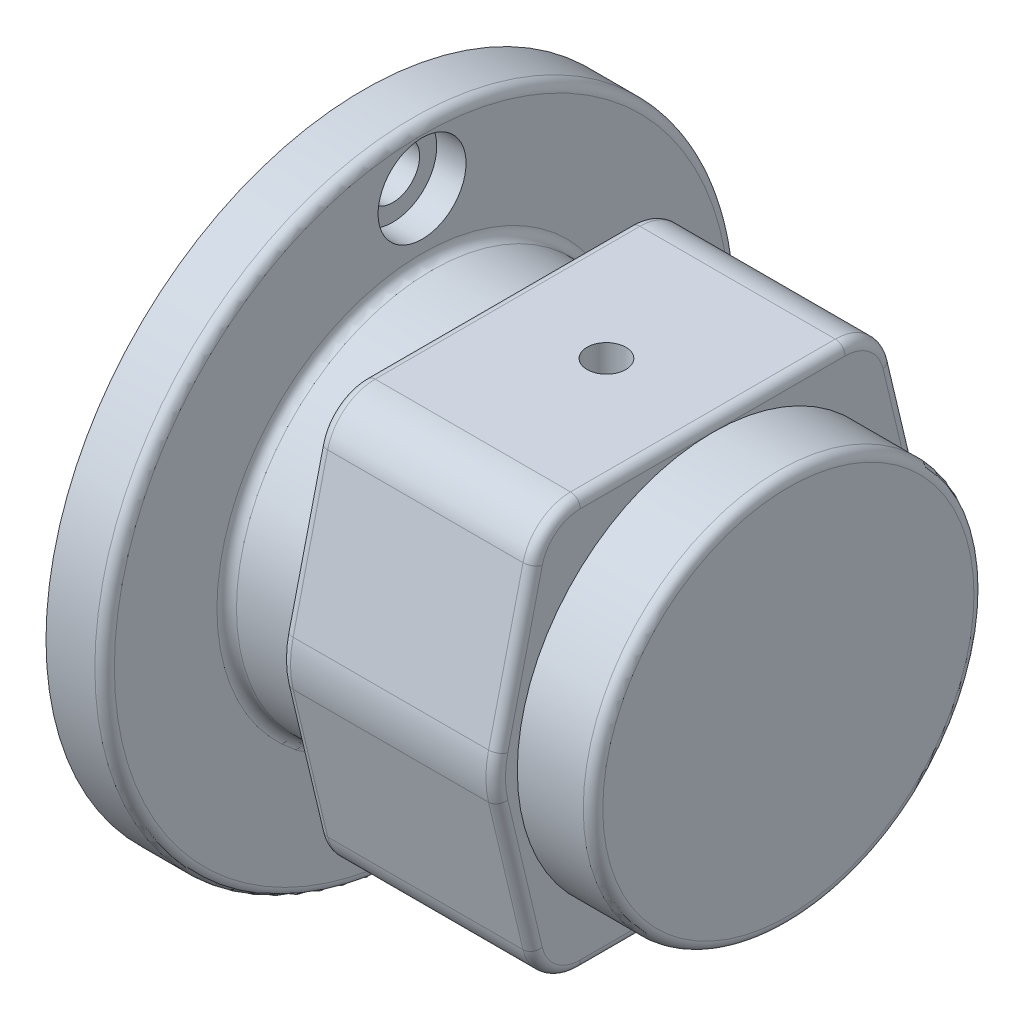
ISO-10303-21;
HEADER;
FILE_DESCRIPTION(('STEP AP214'),'2;1');
FILE_NAME('part.step','',(''),(''),'','','');
FILE_SCHEMA(('AUTOMOTIVE_DESIGN { 1 0 10303 214 1 1 1 1 }'));
ENDSEC;
DATA;
#1=APPLICATION_CONTEXT('core data for automotive mechanical design processes');
#2=APPLICATION_PROTOCOL_DEFINITION('international standard','automotive_design',2000,#1);
#3=PRODUCT_CONTEXT('',#1,'mechanical');
#4=PRODUCT('Part','Part','',(#3));
#5=PRODUCT_RELATED_PRODUCT_CATEGORY('part','',(#4));
#6=PRODUCT_DEFINITION_FORMATION('','',#4);
#7=PRODUCT_DEFINITION_CONTEXT('part definition',#1,'design');
#8=PRODUCT_DEFINITION('design','',#6,#7);
#9=PRODUCT_DEFINITION_SHAPE('','',#8);
#10=(LENGTH_UNIT() NAMED_UNIT(*) SI_UNIT(.MILLI.,.METRE.));
#11=(NAMED_UNIT(*) PLANE_ANGLE_UNIT() SI_UNIT($,.RADIAN.));
#12=(NAMED_UNIT(*) SI_UNIT($,.STERADIAN.) SOLID_ANGLE_UNIT());
#13=UNCERTAINTY_MEASURE_WITH_UNIT(LENGTH_MEASURE(1.E-05),#10,'distance_accuracy_value','');
#14=(GEOMETRIC_REPRESENTATION_CONTEXT(3) GLOBAL_UNCERTAINTY_ASSIGNED_CONTEXT((#13)) GLOBAL_UNIT_ASSIGNED_CONTEXT((#10,
#11,#12)) REPRESENTATION_CONTEXT('',''));
#15=CARTESIAN_POINT('',(0.,0.,0.));
#16=DIRECTION('',(0.,0.,1.));
#17=DIRECTION('',(1.,0.,0.));
#18=AXIS2_PLACEMENT_3D('',#15,#16,#17);
#19=CARTESIAN_POINT('',(71.5,32.,-27.101412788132));
#20=DIRECTION('',(1.,0.,0.));
#21=DIRECTION('',(0.,0.,-1.));
#22=AXIS2_PLACEMENT_3D('',#19,#20,#21);
#23=PLANE('',#22);
#24=DIRECTION('',(0.,0.,-1.));
#25=VECTOR('',#24,1.);
#26=CARTESIAN_POINT('',(71.5,40.,27.1014127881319));
#27=LINE('',#26,#25);
#28=CARTESIAN_POINT('',(71.5,40.,0.));
#29=VERTEX_POINT('',#28);
#30=CARTESIAN_POINT('',(71.5,40.,27.1014127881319));
#31=VERTEX_POINT('',#30);
#32=EDGE_CURVE('E307',#29,#31,#27,.F.);
#33=ORIENTED_EDGE('',*,*,#32,.T.);
#34=CARTESIAN_POINT('',(71.5,32.,27.101412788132));
#35=DIRECTION('',(1.,0.,0.));
#36=DIRECTION('',(0.,0.,-1.));
#37=AXIS2_PLACEMENT_3D('',#34,#35,#36);
#38=CIRCLE('',#37,8.);
#39=CARTESIAN_POINT('',(71.5,33.8529642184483,34.8838625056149));
#40=VERTEX_POINT('',#39);
#41=EDGE_CURVE('E332',#31,#40,#38,.T.);
#42=ORIENTED_EDGE('',*,*,#41,.T.);
#43=DIRECTION('',(0.,0.972806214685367,-0.23162052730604));
#44=VECTOR('',#43,1.);
#45=CARTESIAN_POINT('',(71.5,4.16916949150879,41.9514326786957));
#46=LINE('',#45,#44);
#47=CARTESIAN_POINT('',(71.5,4.16916949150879,41.9514326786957));
#48=VERTEX_POINT('',#47);
#49=EDGE_CURVE('E53',#40,#48,#46,.F.);
#50=ORIENTED_EDGE('',*,*,#49,.T.);
#51=CARTESIAN_POINT('',(71.5,0.,24.4409208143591));
#52=DIRECTION('',(1.,0.,0.));
#53=DIRECTION('',(0.,0.,-1.));
#54=AXIS2_PLACEMENT_3D('',#51,#52,#53);
#55=CIRCLE('',#54,18.);
#56=CARTESIAN_POINT('',(71.5,-4.16916949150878,41.9514326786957));
#57=VERTEX_POINT('',#56);
#58=EDGE_CURVE('E329',#48,#57,#55,.T.);
#59=ORIENTED_EDGE('',*,*,#58,.T.);
#60=DIRECTION('',(0.,0.972806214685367,0.23162052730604));
#61=VECTOR('',#60,1.);
#62=CARTESIAN_POINT('',(71.5,-33.8529642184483,34.8838625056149));
#63=LINE('',#62,#61);
#64=CARTESIAN_POINT('',(71.5,-33.8529642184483,34.8838625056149));
#65=VERTEX_POINT('',#64);
#66=EDGE_CURVE('E327',#57,#65,#63,.F.);
#67=ORIENTED_EDGE('',*,*,#66,.T.);
#68=CARTESIAN_POINT('',(71.5,-32.,27.101412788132));
#69=DIRECTION('',(1.,0.,0.));
#70=DIRECTION('',(0.,0.,-1.));
#71=AXIS2_PLACEMENT_3D('',#68,#69,#70);
#72=CIRCLE('',#71,8.);
#73=CARTESIAN_POINT('',(71.5,-40.,27.1014127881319));
#74=VERTEX_POINT('',#73);
#75=EDGE_CURVE('E325',#65,#74,#72,.T.);
#76=ORIENTED_EDGE('',*,*,#75,.T.);
#77=DIRECTION('',(0.,0.,1.));
#78=VECTOR('',#77,1.);
#79=CARTESIAN_POINT('',(71.5,-40.,-27.1014127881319));
#80=LINE('',#79,#78);
#81=CARTESIAN_POINT('',(71.5,-40.,0.));
#82=VERTEX_POINT('',#81);
#83=EDGE_CURVE('E323',#74,#82,#80,.F.);
#84=ORIENTED_EDGE('',*,*,#83,.T.);
#85=CARTESIAN_POINT('',(71.5,0.,0.));
#86=DIRECTION('',(1.,0.,0.));
#87=DIRECTION('',(0.,0.,-1.));
#88=AXIS2_PLACEMENT_3D('',#85,#86,#87);
#89=CIRCLE('',#88,40.);
#90=EDGE_CURVE('E416',#29,#82,#89,.T.);
#91=ORIENTED_EDGE('',*,*,#90,.F.);
#92=EDGE_LOOP('',(#33,#42,#50,#59,#67,#76,#84,#91));
#93=FACE_BOUND('',#92,.T.);
#94=ADVANCED_FACE('F31',(#93),#23,.T.);
#95=CARTESIAN_POINT('',(27.5,32.,-27.101412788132));
#96=DIRECTION('',(1.,0.,0.));
#97=DIRECTION('',(0.,0.,-1.));
#98=AXIS2_PLACEMENT_3D('',#95,#96,#97);
#99=PLANE('',#98);
#100=CARTESIAN_POINT('',(27.5,0.,24.4409208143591));
#101=DIRECTION('',(1.,0.,0.));
#102=DIRECTION('',(0.,0.,-1.));
#103=AXIS2_PLACEMENT_3D('',#100,#101,#102);
#104=CIRCLE('',#103,18.);
#105=CARTESIAN_POINT('',(27.5,-4.16916949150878,41.9514326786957));
#106=VERTEX_POINT('',#105);
#107=CARTESIAN_POINT('',(27.5,4.16916949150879,41.9514326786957));
#108=VERTEX_POINT('',#107);
#109=EDGE_CURVE('E257',#106,#108,#104,.F.);
#110=ORIENTED_EDGE('',*,*,#109,.T.);
#111=DIRECTION('',(0.,0.972806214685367,-0.23162052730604));
#112=VECTOR('',#111,1.);
#113=CARTESIAN_POINT('',(27.5,46.0660472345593,31.975985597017));
#114=LINE('',#113,#112);
#115=CARTESIAN_POINT('',(27.5,33.8529642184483,34.8838625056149));
#116=VERTEX_POINT('',#115);
#117=EDGE_CURVE('E259',#108,#116,#114,.T.);
#118=ORIENTED_EDGE('',*,*,#117,.T.);
#119=CARTESIAN_POINT('',(27.5,32.,27.101412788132));
#120=DIRECTION('',(1.,0.,0.));
#121=DIRECTION('',(0.,0.,-1.));
#122=AXIS2_PLACEMENT_3D('',#119,#120,#121);
#123=CIRCLE('',#122,8.);
#124=CARTESIAN_POINT('',(27.5,40.,27.1014127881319));
#125=VERTEX_POINT('',#124);
#126=EDGE_CURVE('E214',#116,#125,#123,.F.);
#127=ORIENTED_EDGE('',*,*,#126,.T.);
#128=DIRECTION('',(0.,0.,-1.));
#129=VECTOR('',#128,1.);
#130=CARTESIAN_POINT('',(27.5,40.,-27.101412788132));
#131=LINE('',#130,#129);
#132=CARTESIAN_POINT('',(27.5,40.,0.));
#133=VERTEX_POINT('',#132);
#134=EDGE_CURVE('E207',#125,#133,#131,.T.);
#135=ORIENTED_EDGE('',*,*,#134,.T.);
#136=CARTESIAN_POINT('',(27.5,0.,0.));
#137=DIRECTION('',(1.,0.,0.));
#138=DIRECTION('',(0.,0.,-1.));
#139=AXIS2_PLACEMENT_3D('',#136,#137,#138);
#140=CIRCLE('',#139,40.);
#141=CARTESIAN_POINT('',(27.5,-40.,0.));
#142=VERTEX_POINT('',#141);
#143=EDGE_CURVE('E211',#133,#142,#140,.T.);
#144=ORIENTED_EDGE('',*,*,#143,.T.);
#145=DIRECTION('',(0.,0.,1.));
#146=VECTOR('',#145,1.);
#147=CARTESIAN_POINT('',(27.5,-40.,-27.101412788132));
#148=LINE('',#147,#146);
#149=CARTESIAN_POINT('',(27.5,-40.,27.1014127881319));
#150=VERTEX_POINT('',#149);
#151=EDGE_CURVE('E251',#142,#150,#148,.T.);
#152=ORIENTED_EDGE('',*,*,#151,.T.);
#153=CARTESIAN_POINT('',(27.5,-32.,27.101412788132));
#154=DIRECTION('',(1.,0.,0.));
#155=DIRECTION('',(0.,0.,-1.));
#156=AXIS2_PLACEMENT_3D('',#153,#154,#155);
#157=CIRCLE('',#156,8.);
#158=CARTESIAN_POINT('',(27.5,-33.8529642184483,34.8838625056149));
#159=VERTEX_POINT('',#158);
#160=EDGE_CURVE('E253',#150,#159,#157,.F.);
#161=ORIENTED_EDGE('',*,*,#160,.T.);
#162=DIRECTION('',(0.,0.972806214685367,0.23162052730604));
#163=VECTOR('',#162,1.);
#164=CARTESIAN_POINT('',(27.5,14.5004763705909,46.3965864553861));
#165=LINE('',#164,#163);
#166=EDGE_CURVE('E255',#159,#106,#165,.T.);
#167=ORIENTED_EDGE('',*,*,#166,.T.);
#168=EDGE_LOOP('',(#110,#118,#127,#135,#144,#152,#161,#167));
#169=FACE_BOUND('',#168,.T.);
#170=ADVANCED_FACE('F209',(#169),#99,.F.);
#171=CARTESIAN_POINT('',(0.,0.,0.));
#172=DIRECTION('',(-1.,0.,0.));
#173=DIRECTION('',(0.,0.,1.));
#174=AXIS2_PLACEMENT_3D('',#171,#172,#173);
#175=CYLINDRICAL_SURFACE('',#174,40.);
#176=CARTESIAN_POINT('',(14.,0.,0.));
#177=DIRECTION('',(-1.,0.,0.));
#178=DIRECTION('',(0.,0.,1.));
#179=AXIS2_PLACEMENT_3D('',#176,#177,#178);
#180=CIRCLE('',#179,40.);
#181=CARTESIAN_POINT('',(14.,0.,40.));
#182=VERTEX_POINT('',#181);
#183=EDGE_CURVE('E340',#182,#182,#180,.F.);
#184=ORIENTED_EDGE('',*,*,#183,.T.);
#185=EDGE_LOOP('',(#184));
#186=FACE_BOUND('',#185,.T.);
#187=ORIENTED_EDGE('',*,*,#143,.F.);
#188=EDGE_CURVE('E223',#142,#133,#140,.T.);
#189=ORIENTED_EDGE('',*,*,#188,.F.);
#190=EDGE_LOOP('',(#187,#189));
#191=FACE_BOUND('',#190,.T.);
#192=ADVANCED_FACE('F231',(#186,#191),#175,.T.);
#193=CARTESIAN_POINT('',(0.,0.,0.));
#194=DIRECTION('',(1.,0.,0.));
#195=DIRECTION('',(0.,0.,-1.));
#196=AXIS2_PLACEMENT_3D('',#193,#194,#195);
#197=PLANE('',#196);
#198=CARTESIAN_POINT('',(0.,0.,0.));
#199=DIRECTION('',(-1.,0.,0.));
#200=DIRECTION('',(0.,0.,1.));
#201=AXIS2_PLACEMENT_3D('',#198,#199,#200);
#202=CIRCLE('',#201,32.5);
#203=CARTESIAN_POINT('',(0.,0.,32.5));
#204=VERTEX_POINT('',#203);
#205=EDGE_CURVE('E229',#204,#204,#202,.T.);
#206=ORIENTED_EDGE('',*,*,#205,.T.);
#207=EDGE_LOOP('',(#206));
#208=FACE_BOUND('',#207,.T.);
#209=ADVANCED_FACE('F33',(#208),#197,.F.);
#210=CARTESIAN_POINT('',(0.,0.,0.));
#211=DIRECTION('',(-1.,0.,0.));
#212=DIRECTION('',(0.,0.,1.));
#213=AXIS2_PLACEMENT_3D('',#210,#211,#212);
#214=CYLINDRICAL_SURFACE('',#213,32.5);
#215=ORIENTED_EDGE('',*,*,#205,.F.);
#216=EDGE_LOOP('',(#215));
#217=FACE_BOUND('',#216,.T.);
#218=CARTESIAN_POINT('',(-6.,0.,0.));
#219=DIRECTION('',(-1.,0.,0.));
#220=DIRECTION('',(0.,0.,1.));
#221=AXIS2_PLACEMENT_3D('',#218,#219,#220);
#222=CIRCLE('',#221,32.5);
#223=CARTESIAN_POINT('',(-6.,0.,32.5));
#224=VERTEX_POINT('',#223);
#225=EDGE_CURVE('E511',#224,#224,#222,.T.);
#226=ORIENTED_EDGE('',*,*,#225,.T.);
#227=EDGE_LOOP('',(#226));
#228=FACE_BOUND('',#227,.T.);
#229=ADVANCED_FACE('F518',(#217,#228),#214,.F.);
#230=CARTESIAN_POINT('',(-6.,40.,0.));
#231=DIRECTION('',(1.,0.,0.));
#232=DIRECTION('',(0.,0.,-1.));
#233=AXIS2_PLACEMENT_3D('',#230,#231,#232);
#234=PLANE('',#233);
#235=CARTESIAN_POINT('',(-6.,0.,0.));
#236=DIRECTION('',(1.,0.,0.));
#237=DIRECTION('',(0.,0.,-1.));
#238=AXIS2_PLACEMENT_3D('',#235,#236,#237);
#239=CIRCLE('',#238,38.9999999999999);
#240=CARTESIAN_POINT('',(-6.,0.,-38.9999999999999));
#241=VERTEX_POINT('',#240);
#242=EDGE_CURVE('E39',#241,#241,#239,.F.);
#243=ORIENTED_EDGE('',*,*,#242,.T.);
#244=EDGE_LOOP('',(#243));
#245=FACE_BOUND('',#244,.T.);
#246=ORIENTED_EDGE('',*,*,#225,.F.);
#247=EDGE_LOOP('',(#246));
#248=FACE_BOUND('',#247,.T.);
#249=ADVANCED_FACE('F373',(#245,#248),#234,.F.);
#250=CARTESIAN_POINT('',(0.,0.,0.));
#251=DIRECTION('',(-1.,0.,0.));
#252=DIRECTION('',(0.,0.,1.));
#253=AXIS2_PLACEMENT_3D('',#250,#251,#252);
#254=CYLINDRICAL_SURFACE('',#253,40.);
#255=CARTESIAN_POINT('',(-4.99999999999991,0.,0.));
#256=DIRECTION('',(1.,0.,0.));
#257=DIRECTION('',(0.,0.,-1.));
#258=AXIS2_PLACEMENT_3D('',#255,#256,#257);
#259=CIRCLE('',#258,40.);
#260=CARTESIAN_POINT('',(-4.99999999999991,0.,-40.));
#261=VERTEX_POINT('',#260);
#262=EDGE_CURVE('E11',#261,#261,#259,.T.);
#263=ORIENTED_EDGE('',*,*,#262,.T.);
#264=EDGE_LOOP('',(#263));
#265=FACE_BOUND('',#264,.T.);
#266=CARTESIAN_POINT('',(0.,0.,0.));
#267=DIRECTION('',(-1.,0.,0.));
#268=DIRECTION('',(0.,0.,1.));
#269=AXIS2_PLACEMENT_3D('',#266,#267,#268);
#270=CIRCLE('',#269,40.);
#271=CARTESIAN_POINT('',(0.,0.,40.));
#272=VERTEX_POINT('',#271);
#273=EDGE_CURVE('E508',#272,#272,#270,.T.);
#274=ORIENTED_EDGE('',*,*,#273,.T.);
#275=EDGE_LOOP('',(#274));
#276=FACE_BOUND('',#275,.T.);
#277=ADVANCED_FACE('F523',(#265,#276),#254,.T.);
#278=CARTESIAN_POINT('',(0.,40.,0.));
#279=DIRECTION('',(1.,0.,0.));
#280=DIRECTION('',(0.,0.,-1.));
#281=AXIS2_PLACEMENT_3D('',#278,#279,#280);
#282=PLANE('',#281);
#283=CARTESIAN_POINT('',(0.,-53.5,-3.73588719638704E-13));
#284=DIRECTION('',(1.,0.,0.));
#285=DIRECTION('',(0.,0.,-1.));
#286=AXIS2_PLACEMENT_3D('',#283,#284,#285);
#287=CIRCLE('',#286,5.5);
#288=CARTESIAN_POINT('',(0.,-53.5,-5.50000000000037));
#289=VERTEX_POINT('',#288);
#290=EDGE_CURVE('E361',#289,#289,#287,.T.);
#291=ORIENTED_EDGE('',*,*,#290,.T.);
#292=EDGE_LOOP('',(#291));
#293=FACE_BOUND('',#292,.T.);
#294=CARTESIAN_POINT('',(0.,53.5,0.));
#295=DIRECTION('',(1.,0.,0.));
#296=DIRECTION('',(0.,0.,-1.));
#297=AXIS2_PLACEMENT_3D('',#294,#295,#296);
#298=CIRCLE('',#297,5.5);
#299=CARTESIAN_POINT('',(0.,53.5,-5.5));
#300=VERTEX_POINT('',#299);
#301=EDGE_CURVE('E356',#300,#300,#298,.T.);
#302=ORIENTED_EDGE('',*,*,#301,.T.);
#303=EDGE_LOOP('',(#302));
#304=FACE_BOUND('',#303,.T.);
#305=ORIENTED_EDGE('',*,*,#273,.F.);
#306=EDGE_LOOP('',(#305));
#307=FACE_BOUND('',#306,.T.);
#308=CARTESIAN_POINT('',(0.,0.,0.));
#309=DIRECTION('',(-1.,0.,0.));
#310=DIRECTION('',(0.,0.,1.));
#311=AXIS2_PLACEMENT_3D('',#308,#309,#310);
#312=CIRCLE('',#311,65.);
#313=CARTESIAN_POINT('',(0.,0.,65.));
#314=VERTEX_POINT('',#313);
#315=EDGE_CURVE('E420',#314,#314,#312,.T.);
#316=ORIENTED_EDGE('',*,*,#315,.T.);
#317=EDGE_LOOP('',(#316));
#318=FACE_BOUND('',#317,.T.);
#319=ADVANCED_FACE('F528',(#293,#304,#307,#318),#282,.F.);
#320=CARTESIAN_POINT('',(0.,0.,0.));
#321=DIRECTION('',(-1.,0.,0.));
#322=DIRECTION('',(0.,0.,1.));
#323=AXIS2_PLACEMENT_3D('',#320,#321,#322);
#324=CYLINDRICAL_SURFACE('',#323,65.);
#325=CARTESIAN_POINT('',(10.,0.,0.));
#326=DIRECTION('',(-1.,0.,0.));
#327=DIRECTION('',(0.,0.,1.));
#328=AXIS2_PLACEMENT_3D('',#325,#326,#327);
#329=CIRCLE('',#328,65.);
#330=CARTESIAN_POINT('',(10.,0.,65.));
#331=VERTEX_POINT('',#330);
#332=EDGE_CURVE('E343',#331,#331,#329,.T.);
#333=ORIENTED_EDGE('',*,*,#332,.T.);
#334=EDGE_LOOP('',(#333));
#335=FACE_BOUND('',#334,.T.);
#336=ORIENTED_EDGE('',*,*,#315,.F.);
#337=EDGE_LOOP('',(#336));
#338=FACE_BOUND('',#337,.T.);
#339=ADVANCED_FACE('F534',(#335,#338),#324,.T.);
#340=CARTESIAN_POINT('',(12.,65.,0.));
#341=DIRECTION('',(-1.,0.,0.));
#342=DIRECTION('',(0.,0.,1.));
#343=AXIS2_PLACEMENT_3D('',#340,#341,#342);
#344=PLANE('',#343);
#345=CARTESIAN_POINT('',(12.,-53.5,-3.73588719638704E-13));
#346=DIRECTION('',(1.,0.,0.));
#347=DIRECTION('',(0.,0.,-1.));
#348=AXIS2_PLACEMENT_3D('',#345,#346,#347);
#349=CIRCLE('',#348,9.);
#350=CARTESIAN_POINT('',(12.,-53.5,-9.00000000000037));
#351=VERTEX_POINT('',#350);
#352=EDGE_CURVE('E365',#351,#351,#349,.T.);
#353=ORIENTED_EDGE('',*,*,#352,.F.);
#354=EDGE_LOOP('',(#353));
#355=FACE_BOUND('',#354,.T.);
#356=CARTESIAN_POINT('',(12.,53.5,0.));
#357=DIRECTION('',(1.,0.,0.));
#358=DIRECTION('',(0.,0.,-1.));
#359=AXIS2_PLACEMENT_3D('',#356,#357,#358);
#360=CIRCLE('',#359,9.);
#361=CARTESIAN_POINT('',(12.,53.5,-9.));
#362=VERTEX_POINT('',#361);
#363=EDGE_CURVE('E360',#362,#362,#360,.T.);
#364=ORIENTED_EDGE('',*,*,#363,.F.);
#365=EDGE_LOOP('',(#364));
#366=FACE_BOUND('',#365,.T.);
#367=CARTESIAN_POINT('',(12.,0.,0.));
#368=DIRECTION('',(-1.,0.,0.));
#369=DIRECTION('',(0.,0.,1.));
#370=AXIS2_PLACEMENT_3D('',#367,#368,#369);
#371=CIRCLE('',#370,42.);
#372=CARTESIAN_POINT('',(12.,0.,42.));
#373=VERTEX_POINT('',#372);
#374=EDGE_CURVE('E337',#373,#373,#371,.T.);
#375=ORIENTED_EDGE('',*,*,#374,.T.);
#376=EDGE_LOOP('',(#375));
#377=FACE_BOUND('',#376,.T.);
#378=CARTESIAN_POINT('',(12.,0.,0.));
#379=DIRECTION('',(-1.,0.,0.));
#380=DIRECTION('',(0.,0.,1.));
#381=AXIS2_PLACEMENT_3D('',#378,#379,#380);
#382=CIRCLE('',#381,63.);
#383=CARTESIAN_POINT('',(12.,0.,63.));
#384=VERTEX_POINT('',#383);
#385=EDGE_CURVE('E334',#384,#384,#382,.F.);
#386=ORIENTED_EDGE('',*,*,#385,.T.);
#387=EDGE_LOOP('',(#386));
#388=FACE_BOUND('',#387,.T.);
#389=ADVANCED_FACE('F406',(#355,#366,#377,#388),#344,.F.);
#390=CARTESIAN_POINT('',(27.5,-32.,-27.101412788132));
#391=DIRECTION('',(1.,0.,0.));
#392=DIRECTION('',(0.,0.,-1.));
#393=AXIS2_PLACEMENT_3D('',#390,#391,#392);
#394=CIRCLE('',#393,8.);
#395=CARTESIAN_POINT('',(27.5,-33.8529642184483,-34.8838625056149));
#396=VERTEX_POINT('',#395);
#397=CARTESIAN_POINT('',(27.5,-40.,-27.1014127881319));
#398=VERTEX_POINT('',#397);
#399=EDGE_CURVE('E247',#396,#398,#394,.F.);
#400=ORIENTED_EDGE('',*,*,#399,.T.);
#401=DIRECTION('',(0.,0.,1.));
#402=VECTOR('',#401,1.);
#403=CARTESIAN_POINT('',(27.5,-40.,-27.101412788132));
#404=LINE('',#403,#402);
#405=EDGE_CURVE('E227',#398,#142,#404,.T.);
#406=ORIENTED_EDGE('',*,*,#405,.T.);
#407=ORIENTED_EDGE('',*,*,#188,.T.);
#408=DIRECTION('',(0.,0.,-1.));
#409=VECTOR('',#408,1.);
#410=CARTESIAN_POINT('',(27.5,40.,-27.101412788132));
#411=LINE('',#410,#409);
#412=CARTESIAN_POINT('',(27.5,40.,-27.1014127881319));
#413=VERTEX_POINT('',#412);
#414=EDGE_CURVE('E219',#133,#413,#411,.T.);
#415=ORIENTED_EDGE('',*,*,#414,.T.);
#416=CARTESIAN_POINT('',(27.5,32.,-27.101412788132));
#417=DIRECTION('',(1.,0.,0.));
#418=DIRECTION('',(0.,0.,-1.));
#419=AXIS2_PLACEMENT_3D('',#416,#417,#418);
#420=CIRCLE('',#419,8.);
#421=CARTESIAN_POINT('',(27.5,33.8529642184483,-34.8838625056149));
#422=VERTEX_POINT('',#421);
#423=EDGE_CURVE('E218',#413,#422,#420,.F.);
#424=ORIENTED_EDGE('',*,*,#423,.T.);
#425=DIRECTION('',(0.,-0.972806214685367,-0.231620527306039));
#426=VECTOR('',#425,1.);
#427=CARTESIAN_POINT('',(27.5,33.8529642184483,-34.8838625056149));
#428=LINE('',#427,#426);
#429=CARTESIAN_POINT('',(27.5,4.16916949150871,-41.9514326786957));
#430=VERTEX_POINT('',#429);
#431=EDGE_CURVE('E241',#422,#430,#428,.T.);
#432=ORIENTED_EDGE('',*,*,#431,.T.);
#433=CARTESIAN_POINT('',(27.5,0.,-24.4409208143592));
#434=DIRECTION('',(1.,0.,0.));
#435=DIRECTION('',(0.,0.,-1.));
#436=AXIS2_PLACEMENT_3D('',#433,#434,#435);
#437=CIRCLE('',#436,18.);
#438=CARTESIAN_POINT('',(27.5,-4.16916949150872,-41.9514326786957));
#439=VERTEX_POINT('',#438);
#440=EDGE_CURVE('E243',#430,#439,#437,.F.);
#441=ORIENTED_EDGE('',*,*,#440,.T.);
#442=DIRECTION('',(0.,-0.972806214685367,0.231620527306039));
#443=VECTOR('',#442,1.);
#444=CARTESIAN_POINT('',(27.5,26.7135593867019,-49.304463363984));
#445=LINE('',#444,#443);
#446=EDGE_CURVE('E245',#439,#396,#445,.T.);
#447=ORIENTED_EDGE('',*,*,#446,.T.);
#448=EDGE_LOOP('',(#400,#406,#407,#415,#424,#432,#441,#447));
#449=FACE_BOUND('',#448,.T.);
#450=ADVANCED_FACE('F224',(#449),#99,.F.);
#451=EDGE_CURVE('E409',#82,#29,#89,.T.);
#452=ORIENTED_EDGE('',*,*,#451,.F.);
#453=DIRECTION('',(0.,0.,1.));
#454=VECTOR('',#453,1.);
#455=CARTESIAN_POINT('',(71.5,-40.,-27.1014127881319));
#456=LINE('',#455,#454);
#457=CARTESIAN_POINT('',(71.5,-40.,-27.1014127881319));
#458=VERTEX_POINT('',#457);
#459=EDGE_CURVE('E321',#82,#458,#456,.F.);
#460=ORIENTED_EDGE('',*,*,#459,.T.);
#461=CARTESIAN_POINT('',(71.5,-32.,-27.101412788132));
#462=DIRECTION('',(1.,0.,0.));
#463=DIRECTION('',(0.,0.,-1.));
#464=AXIS2_PLACEMENT_3D('',#461,#462,#463);
#465=CIRCLE('',#464,8.);
#466=CARTESIAN_POINT('',(71.5,-33.8529642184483,-34.8838625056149));
#467=VERTEX_POINT('',#466);
#468=EDGE_CURVE('E319',#458,#467,#465,.T.);
#469=ORIENTED_EDGE('',*,*,#468,.T.);
#470=DIRECTION('',(0.,-0.972806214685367,0.231620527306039));
#471=VECTOR('',#470,1.);
#472=CARTESIAN_POINT('',(71.5,-4.16916949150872,-41.9514326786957));
#473=LINE('',#472,#471);
#474=CARTESIAN_POINT('',(71.5,-4.16916949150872,-41.9514326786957));
#475=VERTEX_POINT('',#474);
#476=EDGE_CURVE('E317',#467,#475,#473,.F.);
#477=ORIENTED_EDGE('',*,*,#476,.T.);
#478=CARTESIAN_POINT('',(71.5,0.,-24.4409208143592));
#479=DIRECTION('',(1.,0.,0.));
#480=DIRECTION('',(0.,0.,-1.));
#481=AXIS2_PLACEMENT_3D('',#478,#479,#480);
#482=CIRCLE('',#481,18.);
#483=CARTESIAN_POINT('',(71.5,4.16916949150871,-41.9514326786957));
#484=VERTEX_POINT('',#483);
#485=EDGE_CURVE('E315',#475,#484,#482,.T.);
#486=ORIENTED_EDGE('',*,*,#485,.T.);
#487=DIRECTION('',(0.,-0.972806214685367,-0.231620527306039));
#488=VECTOR('',#487,1.);
#489=CARTESIAN_POINT('',(71.5,33.8529642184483,-34.8838625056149));
#490=LINE('',#489,#488);
#491=CARTESIAN_POINT('',(71.5,33.8529642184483,-34.8838625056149));
#492=VERTEX_POINT('',#491);
#493=EDGE_CURVE('E313',#484,#492,#490,.F.);
#494=ORIENTED_EDGE('',*,*,#493,.T.);
#495=CARTESIAN_POINT('',(71.5,32.,-27.101412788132));
#496=DIRECTION('',(1.,0.,0.));
#497=DIRECTION('',(0.,0.,-1.));
#498=AXIS2_PLACEMENT_3D('',#495,#496,#497);
#499=CIRCLE('',#498,8.);
#500=CARTESIAN_POINT('',(71.5,40.,-27.1014127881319));
#501=VERTEX_POINT('',#500);
#502=EDGE_CURVE('E311',#492,#501,#499,.T.);
#503=ORIENTED_EDGE('',*,*,#502,.T.);
#504=DIRECTION('',(0.,0.,-1.));
#505=VECTOR('',#504,1.);
#506=CARTESIAN_POINT('',(71.5,40.,27.1014127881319));
#507=LINE('',#506,#505);
#508=EDGE_CURVE('E309',#501,#29,#507,.F.);
#509=ORIENTED_EDGE('',*,*,#508,.T.);
#510=EDGE_LOOP('',(#452,#460,#469,#477,#486,#494,#503,#509));
#511=FACE_BOUND('',#510,.T.);
#512=ADVANCED_FACE('F390',(#511),#23,.T.);
#513=CARTESIAN_POINT('',(27.5,32.,-27.101412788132));
#514=DIRECTION('',(1.,0.,0.));
#515=DIRECTION('',(0.,0.,-1.));
#516=AXIS2_PLACEMENT_3D('',#513,#514,#515);
#517=CYLINDRICAL_SURFACE('',#516,10.);
#518=DIRECTION('',(1.,0.,0.));
#519=VECTOR('',#518,1.);
#520=CARTESIAN_POINT('',(27.5,34.3162052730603,-36.8294749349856));
#521=LINE('',#520,#519);
#522=CARTESIAN_POINT('',(29.5,34.3162052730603,-36.8294749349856));
#523=VERTEX_POINT('',#522);
#524=CARTESIAN_POINT('',(69.5,34.3162052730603,-36.8294749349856));
#525=VERTEX_POINT('',#524);
#526=EDGE_CURVE('E417',#523,#525,#521,.T.);
#527=ORIENTED_EDGE('',*,*,#526,.F.);
#528=CARTESIAN_POINT('',(29.5,32.,-27.101412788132));
#529=DIRECTION('',(1.,0.,0.));
#530=DIRECTION('',(0.,0.,-1.));
#531=AXIS2_PLACEMENT_3D('',#528,#529,#530);
#532=CIRCLE('',#531,10.);
#533=CARTESIAN_POINT('',(29.5,42.,-27.1014127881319));
#534=VERTEX_POINT('',#533);
#535=EDGE_CURVE('E305',#523,#534,#532,.T.);
#536=ORIENTED_EDGE('',*,*,#535,.T.);
#537=DIRECTION('',(1.,0.,0.));
#538=VECTOR('',#537,1.);
#539=CARTESIAN_POINT('',(27.5,42.,-27.1014127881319));
#540=LINE('',#539,#538);
#541=CARTESIAN_POINT('',(69.5,42.,-27.1014127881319));
#542=VERTEX_POINT('',#541);
#543=EDGE_CURVE('E471',#534,#542,#540,.T.);
#544=ORIENTED_EDGE('',*,*,#543,.T.);
#545=CARTESIAN_POINT('',(69.5,32.,-27.101412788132));
#546=DIRECTION('',(1.,0.,0.));
#547=DIRECTION('',(0.,0.,-1.));
#548=AXIS2_PLACEMENT_3D('',#545,#546,#547);
#549=CIRCLE('',#548,10.);
#550=EDGE_CURVE('E303',#542,#525,#549,.F.);
#551=ORIENTED_EDGE('',*,*,#550,.T.);
#552=EDGE_LOOP('',(#527,#536,#544,#551));
#553=FACE_BOUND('',#552,.T.);
#554=ADVANCED_FACE('F397',(#553),#517,.T.);
#555=CARTESIAN_POINT('',(27.5,34.3162052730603,-36.8294749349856));
#556=DIRECTION('',(0.,-0.231620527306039,0.972806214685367));
#557=DIRECTION('',(0.,-0.972806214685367,-0.231620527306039));
#558=AXIS2_PLACEMENT_3D('',#555,#556,#557);
#559=PLANE('',#558);
#560=DIRECTION('',(1.,0.,0.));
#561=VECTOR('',#560,1.);
#562=CARTESIAN_POINT('',(27.5,4.63241054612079,-43.8970451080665));
#563=LINE('',#562,#561);
#564=CARTESIAN_POINT('',(29.5,4.63241054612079,-43.8970451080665));
#565=VERTEX_POINT('',#564);
#566=CARTESIAN_POINT('',(69.5,4.63241054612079,-43.8970451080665));
#567=VERTEX_POINT('',#566);
#568=EDGE_CURVE('E501',#565,#567,#563,.T.);
#569=ORIENTED_EDGE('',*,*,#568,.F.);
#570=DIRECTION('',(0.,-0.972806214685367,-0.231620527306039));
#571=VECTOR('',#570,1.);
#572=CARTESIAN_POINT('',(29.5,34.3162052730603,-36.8294749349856));
#573=LINE('',#572,#571);
#574=EDGE_CURVE('E301',#565,#523,#573,.F.);
#575=ORIENTED_EDGE('',*,*,#574,.T.);
#576=ORIENTED_EDGE('',*,*,#526,.T.);
#577=DIRECTION('',(0.,-0.972806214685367,-0.231620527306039));
#578=VECTOR('',#577,1.);
#579=CARTESIAN_POINT('',(69.5,4.63241054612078,-43.8970451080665));
#580=LINE('',#579,#578);
#581=EDGE_CURVE('E299',#525,#567,#580,.T.);
#582=ORIENTED_EDGE('',*,*,#581,.T.);
#583=EDGE_LOOP('',(#569,#575,#576,#582));
#584=FACE_BOUND('',#583,.T.);
#585=ADVANCED_FACE('F403',(#584),#559,.F.);
#586=CARTESIAN_POINT('',(27.5,0.,-24.4409208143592));
#587=DIRECTION('',(1.,0.,0.));
#588=DIRECTION('',(0.,0.,-1.));
#589=AXIS2_PLACEMENT_3D('',#586,#587,#588);
#590=CYLINDRICAL_SURFACE('',#589,20.);
#591=DIRECTION('',(1.,0.,0.));
#592=VECTOR('',#591,1.);
#593=CARTESIAN_POINT('',(27.5,-4.6324105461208,-43.8970451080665));
#594=LINE('',#593,#592);
#595=CARTESIAN_POINT('',(29.5,-4.6324105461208,-43.8970451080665));
#596=VERTEX_POINT('',#595);
#597=CARTESIAN_POINT('',(69.5,-4.6324105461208,-43.8970451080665));
#598=VERTEX_POINT('',#597);
#599=EDGE_CURVE('E498',#596,#598,#594,.T.);
#600=ORIENTED_EDGE('',*,*,#599,.F.);
#601=CARTESIAN_POINT('',(29.5,0.,-24.4409208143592));
#602=DIRECTION('',(1.,0.,0.));
#603=DIRECTION('',(0.,0.,-1.));
#604=AXIS2_PLACEMENT_3D('',#601,#602,#603);
#605=CIRCLE('',#604,20.);
#606=EDGE_CURVE('E297',#596,#565,#605,.T.);
#607=ORIENTED_EDGE('',*,*,#606,.T.);
#608=ORIENTED_EDGE('',*,*,#568,.T.);
#609=CARTESIAN_POINT('',(69.5,0.,-24.4409208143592));
#610=DIRECTION('',(1.,0.,0.));
#611=DIRECTION('',(0.,0.,-1.));
#612=AXIS2_PLACEMENT_3D('',#609,#610,#611);
#613=CIRCLE('',#612,20.);
#614=EDGE_CURVE('E295',#567,#598,#613,.F.);
#615=ORIENTED_EDGE('',*,*,#614,.T.);
#616=EDGE_LOOP('',(#600,#607,#608,#615));
#617=FACE_BOUND('',#616,.T.);
#618=ADVANCED_FACE('F553',(#617),#590,.T.);
#619=CARTESIAN_POINT('',(27.5,-34.3162052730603,-36.8294749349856));
#620=DIRECTION('',(0.,0.231620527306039,0.972806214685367));
#621=DIRECTION('',(0.,-0.972806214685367,0.231620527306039));
#622=AXIS2_PLACEMENT_3D('',#619,#620,#621);
#623=PLANE('',#622);
#624=DIRECTION('',(1.,0.,0.));
#625=VECTOR('',#624,1.);
#626=CARTESIAN_POINT('',(27.5,-34.3162052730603,-36.8294749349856));
#627=LINE('',#626,#625);
#628=CARTESIAN_POINT('',(29.5,-34.3162052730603,-36.8294749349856));
#629=VERTEX_POINT('',#628);
#630=CARTESIAN_POINT('',(69.5,-34.3162052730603,-36.8294749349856));
#631=VERTEX_POINT('',#630);
#632=EDGE_CURVE('E495',#629,#631,#627,.T.);
#633=ORIENTED_EDGE('',*,*,#632,.F.);
#634=DIRECTION('',(0.,-0.972806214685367,0.231620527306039));
#635=VECTOR('',#634,1.);
#636=CARTESIAN_POINT('',(29.5,-34.3162052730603,-36.8294749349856));
#637=LINE('',#636,#635);
#638=EDGE_CURVE('E293',#629,#596,#637,.F.);
#639=ORIENTED_EDGE('',*,*,#638,.T.);
#640=ORIENTED_EDGE('',*,*,#599,.T.);
#641=DIRECTION('',(0.,-0.972806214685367,0.231620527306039));
#642=VECTOR('',#641,1.);
#643=CARTESIAN_POINT('',(69.5,-34.3162052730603,-36.8294749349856));
#644=LINE('',#643,#642);
#645=EDGE_CURVE('E291',#598,#631,#644,.T.);
#646=ORIENTED_EDGE('',*,*,#645,.T.);
#647=EDGE_LOOP('',(#633,#639,#640,#646));
#648=FACE_BOUND('',#647,.T.);
#649=ADVANCED_FACE('F557',(#648),#623,.F.);
#650=CARTESIAN_POINT('',(27.5,-32.,-27.101412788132));
#651=DIRECTION('',(1.,0.,0.));
#652=DIRECTION('',(0.,0.,-1.));
#653=AXIS2_PLACEMENT_3D('',#650,#651,#652);
#654=CYLINDRICAL_SURFACE('',#653,10.);
#655=DIRECTION('',(1.,0.,0.));
#656=VECTOR('',#655,1.);
#657=CARTESIAN_POINT('',(27.5,-42.,-27.1014127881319));
#658=LINE('',#657,#656);
#659=CARTESIAN_POINT('',(29.5,-42.,-27.1014127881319));
#660=VERTEX_POINT('',#659);
#661=CARTESIAN_POINT('',(69.5,-42.,-27.1014127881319));
#662=VERTEX_POINT('',#661);
#663=EDGE_CURVE('E492',#660,#662,#658,.T.);
#664=ORIENTED_EDGE('',*,*,#663,.F.);
#665=CARTESIAN_POINT('',(29.5,-32.,-27.101412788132));
#666=DIRECTION('',(1.,0.,0.));
#667=DIRECTION('',(0.,0.,-1.));
#668=AXIS2_PLACEMENT_3D('',#665,#666,#667);
#669=CIRCLE('',#668,10.);
#670=EDGE_CURVE('E289',#660,#629,#669,.T.);
#671=ORIENTED_EDGE('',*,*,#670,.T.);
#672=ORIENTED_EDGE('',*,*,#632,.T.);
#673=CARTESIAN_POINT('',(69.5,-32.,-27.101412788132));
#674=DIRECTION('',(1.,0.,0.));
#675=DIRECTION('',(0.,0.,-1.));
#676=AXIS2_PLACEMENT_3D('',#673,#674,#675);
#677=CIRCLE('',#676,10.);
#678=EDGE_CURVE('E287',#631,#662,#677,.F.);
#679=ORIENTED_EDGE('',*,*,#678,.T.);
#680=EDGE_LOOP('',(#664,#671,#672,#679));
#681=FACE_BOUND('',#680,.T.);
#682=ADVANCED_FACE('F561',(#681),#654,.T.);
#683=CARTESIAN_POINT('',(27.5,-42.,-27.1014127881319));
#684=DIRECTION('',(0.,1.,0.));
#685=DIRECTION('',(0.,0.,1.));
#686=AXIS2_PLACEMENT_3D('',#683,#684,#685);
#687=PLANE('',#686);
#688=CARTESIAN_POINT('',(49.5,-42.,-0.246627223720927));
#689=DIRECTION('',(0.,1.,0.));
#690=DIRECTION('',(0.,0.,1.));
#691=AXIS2_PLACEMENT_3D('',#688,#689,#690);
#692=CIRCLE('',#691,3.96874999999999);
#693=CARTESIAN_POINT('',(49.5,-42.,3.72212277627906));
#694=VERTEX_POINT('',#693);
#695=EDGE_CURVE('E366',#694,#694,#692,.T.);
#696=ORIENTED_EDGE('',*,*,#695,.T.);
#697=EDGE_LOOP('',(#696));
#698=FACE_BOUND('',#697,.T.);
#699=DIRECTION('',(1.,0.,0.));
#700=VECTOR('',#699,1.);
#701=CARTESIAN_POINT('',(27.5,-42.,27.1014127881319));
#702=LINE('',#701,#700);
#703=CARTESIAN_POINT('',(29.5,-42.,27.1014127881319));
#704=VERTEX_POINT('',#703);
#705=CARTESIAN_POINT('',(69.5,-42.,27.1014127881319));
#706=VERTEX_POINT('',#705);
#707=EDGE_CURVE('E489',#704,#706,#702,.T.);
#708=ORIENTED_EDGE('',*,*,#707,.F.);
#709=DIRECTION('',(0.,0.,1.));
#710=VECTOR('',#709,1.);
#711=CARTESIAN_POINT('',(29.5,-42.,-27.1014127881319));
#712=LINE('',#711,#710);
#713=EDGE_CURVE('E285',#704,#660,#712,.F.);
#714=ORIENTED_EDGE('',*,*,#713,.T.);
#715=ORIENTED_EDGE('',*,*,#663,.T.);
#716=DIRECTION('',(0.,0.,1.));
#717=VECTOR('',#716,1.);
#718=CARTESIAN_POINT('',(69.5,-42.,27.1014127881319));
#719=LINE('',#718,#717);
#720=EDGE_CURVE('E283',#662,#706,#719,.T.);
#721=ORIENTED_EDGE('',*,*,#720,.T.);
#722=EDGE_LOOP('',(#708,#714,#715,#721));
#723=FACE_BOUND('',#722,.T.);
#724=ADVANCED_FACE('F565',(#698,#723),#687,.F.);
#725=CARTESIAN_POINT('',(27.5,-32.,27.101412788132));
#726=DIRECTION('',(1.,0.,0.));
#727=DIRECTION('',(0.,0.,-1.));
#728=AXIS2_PLACEMENT_3D('',#725,#726,#727);
#729=CYLINDRICAL_SURFACE('',#728,10.);
#730=DIRECTION('',(1.,0.,0.));
#731=VECTOR('',#730,1.);
#732=CARTESIAN_POINT('',(27.5,-34.3162052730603,36.8294749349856));
#733=LINE('',#732,#731);
#734=CARTESIAN_POINT('',(29.5,-34.3162052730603,36.8294749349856));
#735=VERTEX_POINT('',#734);
#736=CARTESIAN_POINT('',(69.5,-34.3162052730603,36.8294749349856));
#737=VERTEX_POINT('',#736);
#738=EDGE_CURVE('E486',#735,#737,#733,.T.);
#739=ORIENTED_EDGE('',*,*,#738,.F.);
#740=CARTESIAN_POINT('',(29.5,-32.,27.101412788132));
#741=DIRECTION('',(1.,0.,0.));
#742=DIRECTION('',(0.,0.,-1.));
#743=AXIS2_PLACEMENT_3D('',#740,#741,#742);
#744=CIRCLE('',#743,10.);
#745=EDGE_CURVE('E281',#735,#704,#744,.T.);
#746=ORIENTED_EDGE('',*,*,#745,.T.);
#747=ORIENTED_EDGE('',*,*,#707,.T.);
#748=CARTESIAN_POINT('',(69.5,-32.,27.101412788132));
#749=DIRECTION('',(1.,0.,0.));
#750=DIRECTION('',(0.,0.,-1.));
#751=AXIS2_PLACEMENT_3D('',#748,#749,#750);
#752=CIRCLE('',#751,10.);
#753=EDGE_CURVE('E279',#706,#737,#752,.F.);
#754=ORIENTED_EDGE('',*,*,#753,.T.);
#755=EDGE_LOOP('',(#739,#746,#747,#754));
#756=FACE_BOUND('',#755,.T.);
#757=ADVANCED_FACE('F569',(#756),#729,.T.);
#758=CARTESIAN_POINT('',(27.5,-34.3162052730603,36.8294749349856));
#759=DIRECTION('',(0.,0.23162052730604,-0.972806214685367));
#760=DIRECTION('',(0.,0.972806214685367,0.23162052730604));
#761=AXIS2_PLACEMENT_3D('',#758,#759,#760);
#762=PLANE('',#761);
#763=DIRECTION('',(1.,0.,0.));
#764=VECTOR('',#763,1.);
#765=CARTESIAN_POINT('',(27.5,-4.63241054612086,43.8970451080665));
#766=LINE('',#765,#764);
#767=CARTESIAN_POINT('',(29.5,-4.63241054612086,43.8970451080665));
#768=VERTEX_POINT('',#767);
#769=CARTESIAN_POINT('',(69.5,-4.63241054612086,43.8970451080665));
#770=VERTEX_POINT('',#769);
#771=EDGE_CURVE('E483',#768,#770,#766,.T.);
#772=ORIENTED_EDGE('',*,*,#771,.F.);
#773=DIRECTION('',(0.,0.972806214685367,0.23162052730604));
#774=VECTOR('',#773,1.);
#775=CARTESIAN_POINT('',(29.5,-34.3162052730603,36.8294749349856));
#776=LINE('',#775,#774);
#777=EDGE_CURVE('E277',#768,#735,#776,.F.);
#778=ORIENTED_EDGE('',*,*,#777,.T.);
#779=ORIENTED_EDGE('',*,*,#738,.T.);
#780=DIRECTION('',(0.,0.972806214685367,0.23162052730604));
#781=VECTOR('',#780,1.);
#782=CARTESIAN_POINT('',(69.5,-4.63241054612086,43.8970451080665));
#783=LINE('',#782,#781);
#784=EDGE_CURVE('E275',#737,#770,#783,.T.);
#785=ORIENTED_EDGE('',*,*,#784,.T.);
#786=EDGE_LOOP('',(#772,#778,#779,#785));
#787=FACE_BOUND('',#786,.T.);
#788=ADVANCED_FACE('F573',(#787),#762,.F.);
#789=CARTESIAN_POINT('',(27.5,0.,24.4409208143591));
#790=DIRECTION('',(1.,0.,0.));
#791=DIRECTION('',(0.,0.,-1.));
#792=AXIS2_PLACEMENT_3D('',#789,#790,#791);
#793=CYLINDRICAL_SURFACE('',#792,20.);
#794=DIRECTION('',(1.,0.,0.));
#795=VECTOR('',#794,1.);
#796=CARTESIAN_POINT('',(27.5,4.63241054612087,43.8970451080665));
#797=LINE('',#796,#795);
#798=CARTESIAN_POINT('',(29.5,4.63241054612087,43.8970451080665));
#799=VERTEX_POINT('',#798);
#800=CARTESIAN_POINT('',(69.5,4.63241054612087,43.8970451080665));
#801=VERTEX_POINT('',#800);
#802=EDGE_CURVE('E480',#799,#801,#797,.T.);
#803=ORIENTED_EDGE('',*,*,#802,.F.);
#804=CARTESIAN_POINT('',(29.5,0.,24.4409208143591));
#805=DIRECTION('',(1.,0.,0.));
#806=DIRECTION('',(0.,0.,-1.));
#807=AXIS2_PLACEMENT_3D('',#804,#805,#806);
#808=CIRCLE('',#807,20.);
#809=EDGE_CURVE('E273',#799,#768,#808,.T.);
#810=ORIENTED_EDGE('',*,*,#809,.T.);
#811=ORIENTED_EDGE('',*,*,#771,.T.);
#812=CARTESIAN_POINT('',(69.5,0.,24.4409208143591));
#813=DIRECTION('',(1.,0.,0.));
#814=DIRECTION('',(0.,0.,-1.));
#815=AXIS2_PLACEMENT_3D('',#812,#813,#814);
#816=CIRCLE('',#815,20.);
#817=EDGE_CURVE('E271',#770,#801,#816,.F.);
#818=ORIENTED_EDGE('',*,*,#817,.T.);
#819=EDGE_LOOP('',(#803,#810,#811,#818));
#820=FACE_BOUND('',#819,.T.);
#821=ADVANCED_FACE('F577',(#820),#793,.T.);
#822=CARTESIAN_POINT('',(27.5,34.3162052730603,36.8294749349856));
#823=DIRECTION('',(0.,-0.23162052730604,-0.972806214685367));
#824=DIRECTION('',(0.,0.972806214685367,-0.23162052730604));
#825=AXIS2_PLACEMENT_3D('',#822,#823,#824);
#826=PLANE('',#825);
#827=DIRECTION('',(1.,0.,0.));
#828=VECTOR('',#827,1.);
#829=CARTESIAN_POINT('',(27.5,34.3162052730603,36.8294749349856));
#830=LINE('',#829,#828);
#831=CARTESIAN_POINT('',(29.5,34.3162052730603,36.8294749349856));
#832=VERTEX_POINT('',#831);
#833=CARTESIAN_POINT('',(69.5,34.3162052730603,36.8294749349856));
#834=VERTEX_POINT('',#833);
#835=EDGE_CURVE('E477',#832,#834,#830,.T.);
#836=ORIENTED_EDGE('',*,*,#835,.F.);
#837=DIRECTION('',(0.,0.972806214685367,-0.23162052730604));
#838=VECTOR('',#837,1.);
#839=CARTESIAN_POINT('',(29.5,34.3162052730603,36.8294749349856));
#840=LINE('',#839,#838);
#841=EDGE_CURVE('E269',#832,#799,#840,.F.);
#842=ORIENTED_EDGE('',*,*,#841,.T.);
#843=ORIENTED_EDGE('',*,*,#802,.T.);
#844=DIRECTION('',(0.,0.972806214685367,-0.23162052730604));
#845=VECTOR('',#844,1.);
#846=CARTESIAN_POINT('',(69.5,34.3162052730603,36.8294749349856));
#847=LINE('',#846,#845);
#848=EDGE_CURVE('E267',#801,#834,#847,.T.);
#849=ORIENTED_EDGE('',*,*,#848,.T.);
#850=EDGE_LOOP('',(#836,#842,#843,#849));
#851=FACE_BOUND('',#850,.T.);
#852=ADVANCED_FACE('F581',(#851),#826,.F.);
#853=CARTESIAN_POINT('',(27.5,32.,27.101412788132));
#854=DIRECTION('',(1.,0.,0.));
#855=DIRECTION('',(0.,0.,-1.));
#856=AXIS2_PLACEMENT_3D('',#853,#854,#855);
#857=CYLINDRICAL_SURFACE('',#856,10.);
#858=DIRECTION('',(1.,0.,0.));
#859=VECTOR('',#858,1.);
#860=CARTESIAN_POINT('',(27.5,42.,27.1014127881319));
#861=LINE('',#860,#859);
#862=CARTESIAN_POINT('',(29.5,42.,27.1014127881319));
#863=VERTEX_POINT('',#862);
#864=CARTESIAN_POINT('',(69.5,42.,27.1014127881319));
#865=VERTEX_POINT('',#864);
#866=EDGE_CURVE('E474',#863,#865,#861,.T.);
#867=ORIENTED_EDGE('',*,*,#866,.F.);
#868=CARTESIAN_POINT('',(29.5,32.,27.101412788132));
#869=DIRECTION('',(1.,0.,0.));
#870=DIRECTION('',(0.,0.,-1.));
#871=AXIS2_PLACEMENT_3D('',#868,#869,#870);
#872=CIRCLE('',#871,10.);
#873=EDGE_CURVE('E264',#863,#832,#872,.T.);
#874=ORIENTED_EDGE('',*,*,#873,.T.);
#875=ORIENTED_EDGE('',*,*,#835,.T.);
#876=CARTESIAN_POINT('',(69.5,32.,27.101412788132));
#877=DIRECTION('',(1.,0.,0.));
#878=DIRECTION('',(0.,0.,-1.));
#879=AXIS2_PLACEMENT_3D('',#876,#877,#878);
#880=CIRCLE('',#879,10.);
#881=EDGE_CURVE('E261',#834,#865,#880,.F.);
#882=ORIENTED_EDGE('',*,*,#881,.T.);
#883=EDGE_LOOP('',(#867,#874,#875,#882));
#884=FACE_BOUND('',#883,.T.);
#885=ADVANCED_FACE('F585',(#884),#857,.T.);
#886=CARTESIAN_POINT('',(27.5,42.,-27.1014127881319));
#887=DIRECTION('',(0.,-1.,0.));
#888=DIRECTION('',(0.,0.,-1.));
#889=AXIS2_PLACEMENT_3D('',#886,#887,#888);
#890=PLANE('',#889);
#891=CARTESIAN_POINT('',(49.5,42.,-0.246627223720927));
#892=DIRECTION('',(0.,1.,0.));
#893=DIRECTION('',(0.,0.,1.));
#894=AXIS2_PLACEMENT_3D('',#891,#892,#893);
#895=CIRCLE('',#894,3.96874999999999);
#896=CARTESIAN_POINT('',(49.5,42.,3.72212277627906));
#897=VERTEX_POINT('',#896);
#898=EDGE_CURVE('E369',#897,#897,#895,.T.);
#899=ORIENTED_EDGE('',*,*,#898,.F.);
#900=EDGE_LOOP('',(#899));
#901=FACE_BOUND('',#900,.T.);
#902=ORIENTED_EDGE('',*,*,#543,.F.);
#903=DIRECTION('',(0.,0.,-1.));
#904=VECTOR('',#903,1.);
#905=CARTESIAN_POINT('',(29.5,42.,-27.1014127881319));
#906=LINE('',#905,#904);
#907=EDGE_CURVE('E348',#534,#863,#906,.F.);
#908=ORIENTED_EDGE('',*,*,#907,.T.);
#909=ORIENTED_EDGE('',*,*,#866,.T.);
#910=DIRECTION('',(0.,0.,-1.));
#911=VECTOR('',#910,1.);
#912=CARTESIAN_POINT('',(69.5,42.,-27.1014127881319));
#913=LINE('',#912,#911);
#914=EDGE_CURVE('E346',#865,#542,#913,.T.);
#915=ORIENTED_EDGE('',*,*,#914,.T.);
#916=EDGE_LOOP('',(#902,#908,#909,#915));
#917=FACE_BOUND('',#916,.T.);
#918=ADVANCED_FACE('F548',(#901,#917),#890,.F.);
#919=CARTESIAN_POINT('',(87.,40.,0.));
#920=DIRECTION('',(-1.,0.,0.));
#921=DIRECTION('',(0.,0.,1.));
#922=AXIS2_PLACEMENT_3D('',#919,#920,#921);
#923=PLANE('',#922);
#924=CARTESIAN_POINT('',(87.,0.,0.));
#925=DIRECTION('',(-1.,0.,0.));
#926=DIRECTION('',(0.,0.,1.));
#927=AXIS2_PLACEMENT_3D('',#924,#925,#926);
#928=CIRCLE('',#927,38.);
#929=CARTESIAN_POINT('',(87.,0.,38.));
#930=VERTEX_POINT('',#929);
#931=EDGE_CURVE('E353',#930,#930,#928,.F.);
#932=ORIENTED_EDGE('',*,*,#931,.T.);
#933=EDGE_LOOP('',(#932));
#934=FACE_BOUND('',#933,.T.);
#935=ADVANCED_FACE('F545',(#934),#923,.F.);
#936=CARTESIAN_POINT('',(85.,0.,0.));
#937=DIRECTION('',(-1.,0.,0.));
#938=DIRECTION('',(0.,0.,1.));
#939=AXIS2_PLACEMENT_3D('',#936,#937,#938);
#940=CIRCLE('',#939,40.);
#941=CARTESIAN_POINT('',(85.,0.,40.));
#942=VERTEX_POINT('',#941);
#943=EDGE_CURVE('E350',#942,#942,#940,.T.);
#944=ORIENTED_EDGE('',*,*,#943,.T.);
#945=EDGE_LOOP('',(#944));
#946=FACE_BOUND('',#945,.T.);
#947=ORIENTED_EDGE('',*,*,#90,.T.);
#948=ORIENTED_EDGE('',*,*,#451,.T.);
#949=EDGE_LOOP('',(#947,#948));
#950=FACE_BOUND('',#949,.T.);
#951=ADVANCED_FACE('F418',(#946,#950),#175,.T.);
#952=CARTESIAN_POINT('',(29.5,-32.,-27.101412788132));
#953=DIRECTION('',(1.,0.,0.));
#954=DIRECTION('',(0.,0.,-1.));
#955=AXIS2_PLACEMENT_3D('',#952,#953,#954);
#956=TOROIDAL_SURFACE('',#955,8.,2.);
#957=CARTESIAN_POINT('',(29.5,-33.8529642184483,-34.8838625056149));
#958=DIRECTION('',(0.,0.972806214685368,-0.231620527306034));
#959=DIRECTION('',(0.,0.231620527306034,0.972806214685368));
#960=AXIS2_PLACEMENT_3D('',#957,#958,#959);
#961=CIRCLE('',#960,2.);
#962=EDGE_CURVE('E465',#629,#396,#961,.T.);
#963=ORIENTED_EDGE('',*,*,#962,.F.);
#964=ORIENTED_EDGE('',*,*,#670,.F.);
#965=CARTESIAN_POINT('',(29.5,-40.,-27.1014127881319));
#966=DIRECTION('',(0.,0.,1.));
#967=DIRECTION('',(1.,0.,0.));
#968=AXIS2_PLACEMENT_3D('',#965,#966,#967);
#969=CIRCLE('',#968,2.);
#970=EDGE_CURVE('E468',#398,#660,#969,.T.);
#971=ORIENTED_EDGE('',*,*,#970,.F.);
#972=ORIENTED_EDGE('',*,*,#399,.F.);
#973=EDGE_LOOP('',(#963,#964,#971,#972));
#974=FACE_BOUND('',#973,.T.);
#975=ADVANCED_FACE('F544',(#974),#956,.T.);
#976=CARTESIAN_POINT('',(29.5,-40.,-27.101412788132));
#977=DIRECTION('',(0.,0.,1.));
#978=DIRECTION('',(1.,0.,0.));
#979=AXIS2_PLACEMENT_3D('',#976,#977,#978);
#980=CYLINDRICAL_SURFACE('',#979,2.);
#981=ORIENTED_EDGE('',*,*,#970,.T.);
#982=ORIENTED_EDGE('',*,*,#713,.F.);
#983=CARTESIAN_POINT('',(29.5,-40.,27.1014127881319));
#984=DIRECTION('',(0.,0.,1.));
#985=DIRECTION('',(0.,-1.,0.));
#986=AXIS2_PLACEMENT_3D('',#983,#984,#985);
#987=CIRCLE('',#986,2.);
#988=EDGE_CURVE('E462',#150,#704,#987,.T.);
#989=ORIENTED_EDGE('',*,*,#988,.F.);
#990=ORIENTED_EDGE('',*,*,#151,.F.);
#991=ORIENTED_EDGE('',*,*,#405,.F.);
#992=EDGE_LOOP('',(#981,#982,#989,#990,#991));
#993=FACE_BOUND('',#992,.T.);
#994=ADVANCED_FACE('F675',(#993),#980,.T.);
#995=CARTESIAN_POINT('',(29.5,26.7135593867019,-49.304463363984));
#996=DIRECTION('',(0.,-0.972806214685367,0.231620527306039));
#997=DIRECTION('',(0.,-0.231620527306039,-0.972806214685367));
#998=AXIS2_PLACEMENT_3D('',#995,#996,#997);
#999=CYLINDRICAL_SURFACE('',#998,2.);
#1000=ORIENTED_EDGE('',*,*,#962,.T.);
#1001=ORIENTED_EDGE('',*,*,#446,.F.);
#1002=CARTESIAN_POINT('',(29.5,-4.16916949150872,-41.9514326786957));
#1003=DIRECTION('',(0.,0.972806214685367,-0.23162052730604));
#1004=DIRECTION('',(0.,0.23162052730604,0.972806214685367));
#1005=AXIS2_PLACEMENT_3D('',#1002,#1003,#1004);
#1006=CIRCLE('',#1005,2.);
#1007=EDGE_CURVE('E459',#596,#439,#1006,.T.);
#1008=ORIENTED_EDGE('',*,*,#1007,.F.);
#1009=ORIENTED_EDGE('',*,*,#638,.F.);
#1010=EDGE_LOOP('',(#1000,#1001,#1008,#1009));
#1011=FACE_BOUND('',#1010,.T.);
#1012=ADVANCED_FACE('F730',(#1011),#999,.T.);
#1013=CARTESIAN_POINT('',(29.5,-32.,27.101412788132));
#1014=DIRECTION('',(1.,0.,0.));
#1015=DIRECTION('',(0.,0.,-1.));
#1016=AXIS2_PLACEMENT_3D('',#1013,#1014,#1015);
#1017=TOROIDAL_SURFACE('',#1016,8.,2.);
#1018=ORIENTED_EDGE('',*,*,#988,.T.);
#1019=ORIENTED_EDGE('',*,*,#745,.F.);
#1020=CARTESIAN_POINT('',(29.5,-33.8529642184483,34.8838625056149));
#1021=DIRECTION('',(0.,0.972806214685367,0.231620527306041));
#1022=DIRECTION('',(0.,-0.231620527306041,0.972806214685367));
#1023=AXIS2_PLACEMENT_3D('',#1020,#1021,#1022);
#1024=CIRCLE('',#1023,2.);
#1025=EDGE_CURVE('E456',#159,#735,#1024,.T.);
#1026=ORIENTED_EDGE('',*,*,#1025,.F.);
#1027=ORIENTED_EDGE('',*,*,#160,.F.);
#1028=EDGE_LOOP('',(#1018,#1019,#1026,#1027));
#1029=FACE_BOUND('',#1028,.T.);
#1030=ADVANCED_FACE('F670',(#1029),#1017,.T.);
#1031=CARTESIAN_POINT('',(29.5,0.,-24.4409208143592));
#1032=DIRECTION('',(1.,0.,0.));
#1033=DIRECTION('',(0.,0.,-1.));
#1034=AXIS2_PLACEMENT_3D('',#1031,#1032,#1033);
#1035=TOROIDAL_SURFACE('',#1034,18.,2.);
#1036=ORIENTED_EDGE('',*,*,#1007,.T.);
#1037=ORIENTED_EDGE('',*,*,#440,.F.);
#1038=CARTESIAN_POINT('',(29.5,4.16916949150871,-41.9514326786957));
#1039=DIRECTION('',(0.,0.972806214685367,0.23162052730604));
#1040=DIRECTION('',(0.,-0.23162052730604,0.972806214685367));
#1041=AXIS2_PLACEMENT_3D('',#1038,#1039,#1040);
#1042=CIRCLE('',#1041,2.);
#1043=EDGE_CURVE('E453',#565,#430,#1042,.T.);
#1044=ORIENTED_EDGE('',*,*,#1043,.F.);
#1045=ORIENTED_EDGE('',*,*,#606,.F.);
#1046=EDGE_LOOP('',(#1036,#1037,#1044,#1045));
#1047=FACE_BOUND('',#1046,.T.);
#1048=ADVANCED_FACE('F724',(#1047),#1035,.T.);
#1049=CARTESIAN_POINT('',(29.5,14.5004763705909,46.3965864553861));
#1050=DIRECTION('',(0.,0.972806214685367,0.23162052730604));
#1051=DIRECTION('',(0.,-0.23162052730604,0.972806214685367));
#1052=AXIS2_PLACEMENT_3D('',#1049,#1050,#1051);
#1053=CYLINDRICAL_SURFACE('',#1052,2.);
#1054=ORIENTED_EDGE('',*,*,#1025,.T.);
#1055=ORIENTED_EDGE('',*,*,#777,.F.);
#1056=CARTESIAN_POINT('',(29.5,-4.16916949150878,41.9514326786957));
#1057=DIRECTION('',(0.,0.972806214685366,0.231620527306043));
#1058=DIRECTION('',(0.,-0.231620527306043,0.972806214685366));
#1059=AXIS2_PLACEMENT_3D('',#1056,#1057,#1058);
#1060=CIRCLE('',#1059,2.);
#1061=EDGE_CURVE('E450',#106,#768,#1060,.T.);
#1062=ORIENTED_EDGE('',*,*,#1061,.F.);
#1063=ORIENTED_EDGE('',*,*,#166,.F.);
#1064=EDGE_LOOP('',(#1054,#1055,#1062,#1063));
#1065=FACE_BOUND('',#1064,.T.);
#1066=ADVANCED_FACE('F658',(#1065),#1053,.T.);
#1067=CARTESIAN_POINT('',(29.5,33.8529642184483,-34.8838625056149));
#1068=DIRECTION('',(0.,-0.972806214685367,-0.231620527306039));
#1069=DIRECTION('',(0.,0.231620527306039,-0.972806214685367));
#1070=AXIS2_PLACEMENT_3D('',#1067,#1068,#1069);
#1071=CYLINDRICAL_SURFACE('',#1070,2.);
#1072=ORIENTED_EDGE('',*,*,#1043,.T.);
#1073=ORIENTED_EDGE('',*,*,#431,.F.);
#1074=CARTESIAN_POINT('',(29.5,33.8529642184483,-34.8838625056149));
#1075=DIRECTION('',(0.,0.972806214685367,0.231620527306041));
#1076=DIRECTION('',(0.,-0.231620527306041,0.972806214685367));
#1077=AXIS2_PLACEMENT_3D('',#1074,#1075,#1076);
#1078=CIRCLE('',#1077,2.);
#1079=EDGE_CURVE('E447',#523,#422,#1078,.T.);
#1080=ORIENTED_EDGE('',*,*,#1079,.F.);
#1081=ORIENTED_EDGE('',*,*,#574,.F.);
#1082=EDGE_LOOP('',(#1072,#1073,#1080,#1081));
#1083=FACE_BOUND('',#1082,.T.);
#1084=ADVANCED_FACE('F718',(#1083),#1071,.T.);
#1085=CARTESIAN_POINT('',(29.5,0.,24.4409208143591));
#1086=DIRECTION('',(1.,0.,0.));
#1087=DIRECTION('',(0.,0.,-1.));
#1088=AXIS2_PLACEMENT_3D('',#1085,#1086,#1087);
#1089=TOROIDAL_SURFACE('',#1088,18.,2.);
#1090=ORIENTED_EDGE('',*,*,#1061,.T.);
#1091=ORIENTED_EDGE('',*,*,#809,.F.);
#1092=CARTESIAN_POINT('',(29.5,4.16916949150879,41.9514326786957));
#1093=DIRECTION('',(0.,0.972806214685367,-0.23162052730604));
#1094=DIRECTION('',(0.,0.23162052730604,0.972806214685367));
#1095=AXIS2_PLACEMENT_3D('',#1092,#1093,#1094);
#1096=CIRCLE('',#1095,2.);
#1097=EDGE_CURVE('E444',#108,#799,#1096,.T.);
#1098=ORIENTED_EDGE('',*,*,#1097,.F.);
#1099=ORIENTED_EDGE('',*,*,#109,.F.);
#1100=EDGE_LOOP('',(#1090,#1091,#1098,#1099));
#1101=FACE_BOUND('',#1100,.T.);
#1102=ADVANCED_FACE('F664',(#1101),#1089,.T.);
#1103=CARTESIAN_POINT('',(29.5,32.,-27.101412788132));
#1104=DIRECTION('',(1.,0.,0.));
#1105=DIRECTION('',(0.,0.,-1.));
#1106=AXIS2_PLACEMENT_3D('',#1103,#1104,#1105);
#1107=TOROIDAL_SURFACE('',#1106,8.,2.);
#1108=ORIENTED_EDGE('',*,*,#1079,.T.);
#1109=ORIENTED_EDGE('',*,*,#423,.F.);
#1110=CARTESIAN_POINT('',(29.5,40.,-27.1014127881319));
#1111=DIRECTION('',(0.,0.,1.));
#1112=DIRECTION('',(0.,-1.,0.));
#1113=AXIS2_PLACEMENT_3D('',#1110,#1111,#1112);
#1114=CIRCLE('',#1113,2.);
#1115=EDGE_CURVE('E236',#534,#413,#1114,.T.);
#1116=ORIENTED_EDGE('',*,*,#1115,.F.);
#1117=ORIENTED_EDGE('',*,*,#535,.F.);
#1118=EDGE_LOOP('',(#1108,#1109,#1116,#1117));
#1119=FACE_BOUND('',#1118,.T.);
#1120=ADVANCED_FACE('F603',(#1119),#1107,.T.);
#1121=CARTESIAN_POINT('',(29.5,46.0660472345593,31.975985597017));
#1122=DIRECTION('',(0.,0.972806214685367,-0.23162052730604));
#1123=DIRECTION('',(0.,0.23162052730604,0.972806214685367));
#1124=AXIS2_PLACEMENT_3D('',#1121,#1122,#1123);
#1125=CYLINDRICAL_SURFACE('',#1124,2.);
#1126=ORIENTED_EDGE('',*,*,#1097,.T.);
#1127=ORIENTED_EDGE('',*,*,#841,.F.);
#1128=CARTESIAN_POINT('',(29.5,33.8529642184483,34.8838625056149));
#1129=DIRECTION('',(0.,0.972806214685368,-0.231620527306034));
#1130=DIRECTION('',(0.,0.231620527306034,0.972806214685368));
#1131=AXIS2_PLACEMENT_3D('',#1128,#1129,#1130);
#1132=CIRCLE('',#1131,2.);
#1133=EDGE_CURVE('E435',#116,#832,#1132,.T.);
#1134=ORIENTED_EDGE('',*,*,#1133,.F.);
#1135=ORIENTED_EDGE('',*,*,#117,.F.);
#1136=EDGE_LOOP('',(#1126,#1127,#1134,#1135));
#1137=FACE_BOUND('',#1136,.T.);
#1138=ADVANCED_FACE('F710',(#1137),#1125,.T.);
#1139=CARTESIAN_POINT('',(29.5,40.,-27.101412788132));
#1140=DIRECTION('',(0.,0.,-1.));
#1141=DIRECTION('',(-1.,0.,0.));
#1142=AXIS2_PLACEMENT_3D('',#1139,#1140,#1141);
#1143=CYLINDRICAL_SURFACE('',#1142,2.);
#1144=ORIENTED_EDGE('',*,*,#414,.F.);
#1145=ORIENTED_EDGE('',*,*,#134,.F.);
#1146=CARTESIAN_POINT('',(29.5,40.,27.1014127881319));
#1147=DIRECTION('',(0.,0.,1.));
#1148=DIRECTION('',(1.,0.,0.));
#1149=AXIS2_PLACEMENT_3D('',#1146,#1147,#1148);
#1150=CIRCLE('',#1149,2.);
#1151=EDGE_CURVE('E432',#863,#125,#1150,.T.);
#1152=ORIENTED_EDGE('',*,*,#1151,.F.);
#1153=ORIENTED_EDGE('',*,*,#907,.F.);
#1154=ORIENTED_EDGE('',*,*,#1115,.T.);
#1155=EDGE_LOOP('',(#1144,#1145,#1152,#1153,#1154));
#1156=FACE_BOUND('',#1155,.T.);
#1157=ADVANCED_FACE('F233',(#1156),#1143,.T.);
#1158=CARTESIAN_POINT('',(29.5,32.,27.101412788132));
#1159=DIRECTION('',(1.,0.,0.));
#1160=DIRECTION('',(0.,0.,-1.));
#1161=AXIS2_PLACEMENT_3D('',#1158,#1159,#1160);
#1162=TOROIDAL_SURFACE('',#1161,8.,2.);
#1163=ORIENTED_EDGE('',*,*,#1133,.T.);
#1164=ORIENTED_EDGE('',*,*,#873,.F.);
#1165=ORIENTED_EDGE('',*,*,#1151,.T.);
#1166=ORIENTED_EDGE('',*,*,#126,.F.);
#1167=EDGE_LOOP('',(#1163,#1164,#1165,#1166));
#1168=FACE_BOUND('',#1167,.T.);
#1169=ADVANCED_FACE('F606',(#1168),#1162,.T.);
#1170=CARTESIAN_POINT('',(69.5,-32.,-27.101412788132));
#1171=DIRECTION('',(1.,0.,0.));
#1172=DIRECTION('',(0.,0.,-1.));
#1173=AXIS2_PLACEMENT_3D('',#1170,#1171,#1172);
#1174=TOROIDAL_SURFACE('',#1173,8.,2.);
#1175=CARTESIAN_POINT('',(69.5,-33.8529642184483,-34.8838625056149));
#1176=DIRECTION('',(0.,0.972806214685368,-0.231620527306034));
#1177=DIRECTION('',(0.,0.231620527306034,0.972806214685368));
#1178=AXIS2_PLACEMENT_3D('',#1175,#1176,#1177);
#1179=CIRCLE('',#1178,2.);
#1180=EDGE_CURVE('E433',#467,#631,#1179,.T.);
#1181=ORIENTED_EDGE('',*,*,#1180,.F.);
#1182=ORIENTED_EDGE('',*,*,#468,.F.);
#1183=CARTESIAN_POINT('',(69.5,-40.,-27.1014127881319));
#1184=DIRECTION('',(0.,0.,1.));
#1185=DIRECTION('',(1.,0.,0.));
#1186=AXIS2_PLACEMENT_3D('',#1183,#1184,#1185);
#1187=CIRCLE('',#1186,2.);
#1188=EDGE_CURVE('E429',#662,#458,#1187,.T.);
#1189=ORIENTED_EDGE('',*,*,#1188,.F.);
#1190=ORIENTED_EDGE('',*,*,#678,.F.);
#1191=EDGE_LOOP('',(#1181,#1182,#1189,#1190));
#1192=FACE_BOUND('',#1191,.T.);
#1193=ADVANCED_FACE('F697',(#1192),#1174,.T.);
#1194=CARTESIAN_POINT('',(69.5,-40.,-27.1014127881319));
#1195=DIRECTION('',(0.,0.,-1.));
#1196=DIRECTION('',(-1.,0.,0.));
#1197=AXIS2_PLACEMENT_3D('',#1194,#1195,#1196);
#1198=CYLINDRICAL_SURFACE('',#1197,2.);
#1199=ORIENTED_EDGE('',*,*,#459,.F.);
#1200=ORIENTED_EDGE('',*,*,#83,.F.);
#1201=CARTESIAN_POINT('',(69.5,-40.,27.1014127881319));
#1202=DIRECTION('',(0.,0.,1.));
#1203=DIRECTION('',(1.,0.,0.));
#1204=AXIS2_PLACEMENT_3D('',#1201,#1202,#1203);
#1205=CIRCLE('',#1204,2.);
#1206=EDGE_CURVE('E438',#706,#74,#1205,.T.);
#1207=ORIENTED_EDGE('',*,*,#1206,.F.);
#1208=ORIENTED_EDGE('',*,*,#720,.F.);
#1209=ORIENTED_EDGE('',*,*,#1188,.T.);
#1210=EDGE_LOOP('',(#1199,#1200,#1207,#1208,#1209));
#1211=FACE_BOUND('',#1210,.T.);
#1212=ADVANCED_FACE('F424',(#1211),#1198,.T.);
#1213=CARTESIAN_POINT('',(69.5,-33.8529642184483,-34.8838625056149));
#1214=DIRECTION('',(0.,0.972806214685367,-0.231620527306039));
#1215=DIRECTION('',(0.,0.231620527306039,0.972806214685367));
#1216=AXIS2_PLACEMENT_3D('',#1213,#1214,#1215);
#1217=CYLINDRICAL_SURFACE('',#1216,2.);
#1218=ORIENTED_EDGE('',*,*,#1180,.T.);
#1219=ORIENTED_EDGE('',*,*,#645,.F.);
#1220=CARTESIAN_POINT('',(69.5,-4.16916949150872,-41.9514326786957));
#1221=DIRECTION('',(0.,0.972806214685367,-0.23162052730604));
#1222=DIRECTION('',(0.,0.23162052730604,0.972806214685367));
#1223=AXIS2_PLACEMENT_3D('',#1220,#1221,#1222);
#1224=CIRCLE('',#1223,2.);
#1225=EDGE_CURVE('E643',#475,#598,#1224,.T.);
#1226=ORIENTED_EDGE('',*,*,#1225,.F.);
#1227=ORIENTED_EDGE('',*,*,#476,.F.);
#1228=EDGE_LOOP('',(#1218,#1219,#1226,#1227));
#1229=FACE_BOUND('',#1228,.T.);
#1230=ADVANCED_FACE('F687',(#1229),#1217,.T.);
#1231=CARTESIAN_POINT('',(69.5,-32.,27.101412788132));
#1232=DIRECTION('',(1.,0.,0.));
#1233=DIRECTION('',(0.,0.,-1.));
#1234=AXIS2_PLACEMENT_3D('',#1231,#1232,#1233);
#1235=TOROIDAL_SURFACE('',#1234,8.,2.);
#1236=ORIENTED_EDGE('',*,*,#1206,.T.);
#1237=ORIENTED_EDGE('',*,*,#75,.F.);
#1238=CARTESIAN_POINT('',(69.5,-33.8529642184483,34.8838625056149));
#1239=DIRECTION('',(0.,0.972806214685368,0.231620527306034));
#1240=DIRECTION('',(0.,-0.231620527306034,0.972806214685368));
#1241=AXIS2_PLACEMENT_3D('',#1238,#1239,#1240);
#1242=CIRCLE('',#1241,2.);
#1243=EDGE_CURVE('E640',#737,#65,#1242,.T.);
#1244=ORIENTED_EDGE('',*,*,#1243,.F.);
#1245=ORIENTED_EDGE('',*,*,#753,.F.);
#1246=EDGE_LOOP('',(#1236,#1237,#1244,#1245));
#1247=FACE_BOUND('',#1246,.T.);
#1248=ADVANCED_FACE('F648',(#1247),#1235,.T.);
#1249=CARTESIAN_POINT('',(69.5,0.,-24.4409208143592));
#1250=DIRECTION('',(1.,0.,0.));
#1251=DIRECTION('',(0.,0.,-1.));
#1252=AXIS2_PLACEMENT_3D('',#1249,#1250,#1251);
#1253=TOROIDAL_SURFACE('',#1252,18.,2.);
#1254=ORIENTED_EDGE('',*,*,#1225,.T.);
#1255=ORIENTED_EDGE('',*,*,#614,.F.);
#1256=CARTESIAN_POINT('',(69.5,4.16916949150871,-41.9514326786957));
#1257=DIRECTION('',(0.,0.972806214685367,0.23162052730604));
#1258=DIRECTION('',(0.,-0.23162052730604,0.972806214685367));
#1259=AXIS2_PLACEMENT_3D('',#1256,#1257,#1258);
#1260=CIRCLE('',#1259,2.);
#1261=EDGE_CURVE('E637',#484,#567,#1260,.T.);
#1262=ORIENTED_EDGE('',*,*,#1261,.F.);
#1263=ORIENTED_EDGE('',*,*,#485,.F.);
#1264=EDGE_LOOP('',(#1254,#1255,#1262,#1263));
#1265=FACE_BOUND('',#1264,.T.);
#1266=ADVANCED_FACE('F693',(#1265),#1253,.T.);
#1267=CARTESIAN_POINT('',(69.5,-33.8529642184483,34.8838625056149));
#1268=DIRECTION('',(0.,-0.972806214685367,-0.23162052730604));
#1269=DIRECTION('',(0.,0.23162052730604,-0.972806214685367));
#1270=AXIS2_PLACEMENT_3D('',#1267,#1268,#1269);
#1271=CYLINDRICAL_SURFACE('',#1270,2.);
#1272=ORIENTED_EDGE('',*,*,#1243,.T.);
#1273=ORIENTED_EDGE('',*,*,#66,.F.);
#1274=CARTESIAN_POINT('',(69.5,-4.16916949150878,41.9514326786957));
#1275=DIRECTION('',(0.,0.972806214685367,0.23162052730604));
#1276=DIRECTION('',(0.,-0.23162052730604,0.972806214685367));
#1277=AXIS2_PLACEMENT_3D('',#1274,#1275,#1276);
#1278=CIRCLE('',#1277,2.);
#1279=EDGE_CURVE('E634',#770,#57,#1278,.T.);
#1280=ORIENTED_EDGE('',*,*,#1279,.F.);
#1281=ORIENTED_EDGE('',*,*,#784,.F.);
#1282=EDGE_LOOP('',(#1272,#1273,#1280,#1281));
#1283=FACE_BOUND('',#1282,.T.);
#1284=ADVANCED_FACE('F818',(#1283),#1271,.T.);
#1285=CARTESIAN_POINT('',(69.5,33.8529642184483,-34.8838625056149));
#1286=DIRECTION('',(0.,0.972806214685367,0.231620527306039));
#1287=DIRECTION('',(0.,-0.231620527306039,0.972806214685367));
#1288=AXIS2_PLACEMENT_3D('',#1285,#1286,#1287);
#1289=CYLINDRICAL_SURFACE('',#1288,2.);
#1290=ORIENTED_EDGE('',*,*,#1261,.T.);
#1291=ORIENTED_EDGE('',*,*,#581,.F.);
#1292=CARTESIAN_POINT('',(69.5,33.8529642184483,-34.8838625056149));
#1293=DIRECTION('',(0.,0.972806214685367,0.231620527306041));
#1294=DIRECTION('',(0.,-0.231620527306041,0.972806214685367));
#1295=AXIS2_PLACEMENT_3D('',#1292,#1293,#1294);
#1296=CIRCLE('',#1295,2.);
#1297=EDGE_CURVE('E629',#492,#525,#1296,.T.);
#1298=ORIENTED_EDGE('',*,*,#1297,.F.);
#1299=ORIENTED_EDGE('',*,*,#493,.F.);
#1300=EDGE_LOOP('',(#1290,#1291,#1298,#1299));
#1301=FACE_BOUND('',#1300,.T.);
#1302=ADVANCED_FACE('F827',(#1301),#1289,.T.);
#1303=CARTESIAN_POINT('',(69.5,0.,24.4409208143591));
#1304=DIRECTION('',(1.,0.,0.));
#1305=DIRECTION('',(0.,0.,-1.));
#1306=AXIS2_PLACEMENT_3D('',#1303,#1304,#1305);
#1307=TOROIDAL_SURFACE('',#1306,18.,2.);
#1308=ORIENTED_EDGE('',*,*,#1279,.T.);
#1309=ORIENTED_EDGE('',*,*,#58,.F.);
#1310=CARTESIAN_POINT('',(69.5,4.16916949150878,41.9514326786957));
#1311=DIRECTION('',(0.,0.972806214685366,-0.231620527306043));
#1312=DIRECTION('',(0.,0.231620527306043,0.972806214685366));
#1313=AXIS2_PLACEMENT_3D('',#1310,#1311,#1312);
#1314=CIRCLE('',#1313,2.);
#1315=EDGE_CURVE('E616',#801,#48,#1314,.T.);
#1316=ORIENTED_EDGE('',*,*,#1315,.F.);
#1317=ORIENTED_EDGE('',*,*,#817,.F.);
#1318=EDGE_LOOP('',(#1308,#1309,#1316,#1317));
#1319=FACE_BOUND('',#1318,.T.);
#1320=ADVANCED_FACE('F837',(#1319),#1307,.T.);
#1321=CARTESIAN_POINT('',(69.5,32.,-27.101412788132));
#1322=DIRECTION('',(1.,0.,0.));
#1323=DIRECTION('',(0.,0.,-1.));
#1324=AXIS2_PLACEMENT_3D('',#1321,#1322,#1323);
#1325=TOROIDAL_SURFACE('',#1324,8.,2.);
#1326=ORIENTED_EDGE('',*,*,#1297,.T.);
#1327=ORIENTED_EDGE('',*,*,#550,.F.);
#1328=CARTESIAN_POINT('',(69.5,40.,-27.1014127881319));
#1329=DIRECTION('',(0.,0.,1.));
#1330=DIRECTION('',(0.,-1.,0.));
#1331=AXIS2_PLACEMENT_3D('',#1328,#1329,#1330);
#1332=CIRCLE('',#1331,2.);
#1333=EDGE_CURVE('E617',#501,#542,#1332,.T.);
#1334=ORIENTED_EDGE('',*,*,#1333,.F.);
#1335=ORIENTED_EDGE('',*,*,#502,.F.);
#1336=EDGE_LOOP('',(#1326,#1327,#1334,#1335));
#1337=FACE_BOUND('',#1336,.T.);
#1338=ADVANCED_FACE('F847',(#1337),#1325,.T.);
#1339=CARTESIAN_POINT('',(69.5,33.8529642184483,34.8838625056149));
#1340=DIRECTION('',(0.,-0.972806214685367,0.23162052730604));
#1341=DIRECTION('',(0.,-0.23162052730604,-0.972806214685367));
#1342=AXIS2_PLACEMENT_3D('',#1339,#1340,#1341);
#1343=CYLINDRICAL_SURFACE('',#1342,2.);
#1344=ORIENTED_EDGE('',*,*,#1315,.T.);
#1345=ORIENTED_EDGE('',*,*,#49,.F.);
#1346=CARTESIAN_POINT('',(69.5,33.8529642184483,34.8838625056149));
#1347=DIRECTION('',(0.,0.972806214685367,-0.231620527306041));
#1348=DIRECTION('',(0.,0.231620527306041,0.972806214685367));
#1349=AXIS2_PLACEMENT_3D('',#1346,#1347,#1348);
#1350=CIRCLE('',#1349,2.);
#1351=EDGE_CURVE('E46',#834,#40,#1350,.T.);
#1352=ORIENTED_EDGE('',*,*,#1351,.F.);
#1353=ORIENTED_EDGE('',*,*,#848,.F.);
#1354=EDGE_LOOP('',(#1344,#1345,#1352,#1353));
#1355=FACE_BOUND('',#1354,.T.);
#1356=ADVANCED_FACE('F615',(#1355),#1343,.T.);
#1357=CARTESIAN_POINT('',(69.5,40.,-27.1014127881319));
#1358=DIRECTION('',(0.,0.,1.));
#1359=DIRECTION('',(1.,0.,0.));
#1360=AXIS2_PLACEMENT_3D('',#1357,#1358,#1359);
#1361=CYLINDRICAL_SURFACE('',#1360,2.);
#1362=ORIENTED_EDGE('',*,*,#1333,.T.);
#1363=ORIENTED_EDGE('',*,*,#914,.F.);
#1364=CARTESIAN_POINT('',(69.5,40.,27.1014127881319));
#1365=DIRECTION('',(0.,0.,1.));
#1366=DIRECTION('',(0.,-1.,0.));
#1367=AXIS2_PLACEMENT_3D('',#1364,#1365,#1366);
#1368=CIRCLE('',#1367,2.);
#1369=EDGE_CURVE('E359',#31,#865,#1368,.T.);
#1370=ORIENTED_EDGE('',*,*,#1369,.F.);
#1371=ORIENTED_EDGE('',*,*,#32,.F.);
#1372=ORIENTED_EDGE('',*,*,#508,.F.);
#1373=EDGE_LOOP('',(#1362,#1363,#1370,#1371,#1372));
#1374=FACE_BOUND('',#1373,.T.);
#1375=ADVANCED_FACE('F624',(#1374),#1361,.T.);
#1376=CARTESIAN_POINT('',(69.5,32.,27.101412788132));
#1377=DIRECTION('',(1.,0.,0.));
#1378=DIRECTION('',(0.,0.,-1.));
#1379=AXIS2_PLACEMENT_3D('',#1376,#1377,#1378);
#1380=TOROIDAL_SURFACE('',#1379,8.,2.);
#1381=ORIENTED_EDGE('',*,*,#1351,.T.);
#1382=ORIENTED_EDGE('',*,*,#41,.F.);
#1383=ORIENTED_EDGE('',*,*,#1369,.T.);
#1384=ORIENTED_EDGE('',*,*,#881,.F.);
#1385=EDGE_LOOP('',(#1381,#1382,#1383,#1384));
#1386=FACE_BOUND('',#1385,.T.);
#1387=ADVANCED_FACE('F619',(#1386),#1380,.T.);
#1388=CARTESIAN_POINT('',(14.,0.,0.));
#1389=DIRECTION('',(-1.,0.,0.));
#1390=DIRECTION('',(0.,0.,1.));
#1391=AXIS2_PLACEMENT_3D('',#1388,#1389,#1390);
#1392=TOROIDAL_SURFACE('',#1391,42.,2.);
#1393=ORIENTED_EDGE('',*,*,#183,.F.);
#1394=EDGE_LOOP('',(#1393));
#1395=FACE_BOUND('',#1394,.T.);
#1396=ORIENTED_EDGE('',*,*,#374,.F.);
#1397=EDGE_LOOP('',(#1396));
#1398=FACE_BOUND('',#1397,.T.);
#1399=ADVANCED_FACE('F881',(#1395,#1398),#1392,.F.);
#1400=CARTESIAN_POINT('',(10.,0.,0.));
#1401=DIRECTION('',(-1.,0.,0.));
#1402=DIRECTION('',(0.,0.,1.));
#1403=AXIS2_PLACEMENT_3D('',#1400,#1401,#1402);
#1404=TOROIDAL_SURFACE('',#1403,63.,2.);
#1405=ORIENTED_EDGE('',*,*,#385,.F.);
#1406=EDGE_LOOP('',(#1405));
#1407=FACE_BOUND('',#1406,.T.);
#1408=ORIENTED_EDGE('',*,*,#332,.F.);
#1409=EDGE_LOOP('',(#1408));
#1410=FACE_BOUND('',#1409,.T.);
#1411=ADVANCED_FACE('F890',(#1407,#1410),#1404,.T.);
#1412=CARTESIAN_POINT('',(85.,0.,0.));
#1413=DIRECTION('',(-1.,0.,0.));
#1414=DIRECTION('',(0.,0.,1.));
#1415=AXIS2_PLACEMENT_3D('',#1412,#1413,#1414);
#1416=TOROIDAL_SURFACE('',#1415,38.,2.);
#1417=ORIENTED_EDGE('',*,*,#931,.F.);
#1418=EDGE_LOOP('',(#1417));
#1419=FACE_BOUND('',#1418,.T.);
#1420=ORIENTED_EDGE('',*,*,#943,.F.);
#1421=EDGE_LOOP('',(#1420));
#1422=FACE_BOUND('',#1421,.T.);
#1423=ADVANCED_FACE('F900',(#1419,#1422),#1416,.T.);
#1424=CARTESIAN_POINT('',(12.,53.5,0.));
#1425=DIRECTION('',(1.,0.,0.));
#1426=DIRECTION('',(0.,0.,-1.));
#1427=AXIS2_PLACEMENT_3D('',#1424,#1425,#1426);
#1428=CYLINDRICAL_SURFACE('',#1427,5.5);
#1429=CARTESIAN_POINT('',(6.,53.5,0.));
#1430=DIRECTION('',(1.,0.,0.));
#1431=DIRECTION('',(0.,0.,-1.));
#1432=AXIS2_PLACEMENT_3D('',#1429,#1430,#1431);
#1433=CIRCLE('',#1432,5.5);
#1434=CARTESIAN_POINT('',(6.,53.5,-5.5));
#1435=VERTEX_POINT('',#1434);
#1436=EDGE_CURVE('E364',#1435,#1435,#1433,.T.);
#1437=ORIENTED_EDGE('',*,*,#1436,.T.);
#1438=EDGE_LOOP('',(#1437));
#1439=FACE_BOUND('',#1438,.T.);
#1440=ORIENTED_EDGE('',*,*,#301,.F.);
#1441=EDGE_LOOP('',(#1440));
#1442=FACE_BOUND('',#1441,.T.);
#1443=ADVANCED_FACE('F910',(#1439,#1442),#1428,.F.);
#1444=CARTESIAN_POINT('',(12.,53.5,0.));
#1445=DIRECTION('',(1.,0.,0.));
#1446=DIRECTION('',(0.,0.,-1.));
#1447=AXIS2_PLACEMENT_3D('',#1444,#1445,#1446);
#1448=CYLINDRICAL_SURFACE('',#1447,9.);
#1449=CARTESIAN_POINT('',(6.,53.5,0.));
#1450=DIRECTION('',(1.,0.,0.));
#1451=DIRECTION('',(0.,0.,-1.));
#1452=AXIS2_PLACEMENT_3D('',#1449,#1450,#1451);
#1453=CIRCLE('',#1452,9.);
#1454=CARTESIAN_POINT('',(6.,53.5,-9.));
#1455=VERTEX_POINT('',#1454);
#1456=EDGE_CURVE('E1179',#1455,#1455,#1453,.T.);
#1457=ORIENTED_EDGE('',*,*,#1456,.F.);
#1458=EDGE_LOOP('',(#1457));
#1459=FACE_BOUND('',#1458,.T.);
#1460=ORIENTED_EDGE('',*,*,#363,.T.);
#1461=EDGE_LOOP('',(#1460));
#1462=FACE_BOUND('',#1461,.T.);
#1463=ADVANCED_FACE('F920',(#1459,#1462),#1448,.F.);
#1464=CARTESIAN_POINT('',(6.,59.,0.));
#1465=DIRECTION('',(-1.,0.,0.));
#1466=DIRECTION('',(0.,0.,1.));
#1467=AXIS2_PLACEMENT_3D('',#1464,#1465,#1466);
#1468=PLANE('',#1467);
#1469=ORIENTED_EDGE('',*,*,#1436,.F.);
#1470=EDGE_LOOP('',(#1469));
#1471=FACE_BOUND('',#1470,.T.);
#1472=ORIENTED_EDGE('',*,*,#1456,.T.);
#1473=EDGE_LOOP('',(#1472));
#1474=FACE_BOUND('',#1473,.T.);
#1475=ADVANCED_FACE('F930',(#1471,#1474),#1468,.F.);
#1476=CARTESIAN_POINT('',(12.,-53.5,-3.73588719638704E-13));
#1477=DIRECTION('',(1.,0.,0.));
#1478=DIRECTION('',(0.,0.,-1.));
#1479=AXIS2_PLACEMENT_3D('',#1476,#1477,#1478);
#1480=CYLINDRICAL_SURFACE('',#1479,5.5);
#1481=CARTESIAN_POINT('',(6.,-53.5,-3.73588719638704E-13));
#1482=DIRECTION('',(1.,0.,0.));
#1483=DIRECTION('',(0.,0.,-1.));
#1484=AXIS2_PLACEMENT_3D('',#1481,#1482,#1483);
#1485=CIRCLE('',#1484,5.5);
#1486=CARTESIAN_POINT('',(6.,-53.5,-5.50000000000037));
#1487=VERTEX_POINT('',#1486);
#1488=EDGE_CURVE('E368',#1487,#1487,#1485,.T.);
#1489=ORIENTED_EDGE('',*,*,#1488,.T.);
#1490=EDGE_LOOP('',(#1489));
#1491=FACE_BOUND('',#1490,.T.);
#1492=ORIENTED_EDGE('',*,*,#290,.F.);
#1493=EDGE_LOOP('',(#1492));
#1494=FACE_BOUND('',#1493,.T.);
#1495=ADVANCED_FACE('F940',(#1491,#1494),#1480,.F.);
#1496=CARTESIAN_POINT('',(12.,-53.5,-3.73588719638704E-13));
#1497=DIRECTION('',(1.,0.,0.));
#1498=DIRECTION('',(0.,0.,-1.));
#1499=AXIS2_PLACEMENT_3D('',#1496,#1497,#1498);
#1500=CYLINDRICAL_SURFACE('',#1499,9.);
#1501=CARTESIAN_POINT('',(6.,-53.5,-3.73588719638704E-13));
#1502=DIRECTION('',(1.,0.,0.));
#1503=DIRECTION('',(0.,0.,-1.));
#1504=AXIS2_PLACEMENT_3D('',#1501,#1502,#1503);
#1505=CIRCLE('',#1504,9.);
#1506=CARTESIAN_POINT('',(6.,-53.5,-9.00000000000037));
#1507=VERTEX_POINT('',#1506);
#1508=EDGE_CURVE('E1170',#1507,#1507,#1505,.T.);
#1509=ORIENTED_EDGE('',*,*,#1508,.F.);
#1510=EDGE_LOOP('',(#1509));
#1511=FACE_BOUND('',#1510,.T.);
#1512=ORIENTED_EDGE('',*,*,#352,.T.);
#1513=EDGE_LOOP('',(#1512));
#1514=FACE_BOUND('',#1513,.T.);
#1515=ADVANCED_FACE('F965',(#1511,#1514),#1500,.F.);
#1516=CARTESIAN_POINT('',(6.,-48.,-3.73588719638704E-13));
#1517=DIRECTION('',(-1.,0.,0.));
#1518=DIRECTION('',(0.,0.,1.));
#1519=AXIS2_PLACEMENT_3D('',#1516,#1517,#1518);
#1520=PLANE('',#1519);
#1521=ORIENTED_EDGE('',*,*,#1488,.F.);
#1522=EDGE_LOOP('',(#1521));
#1523=FACE_BOUND('',#1522,.T.);
#1524=ORIENTED_EDGE('',*,*,#1508,.T.);
#1525=EDGE_LOOP('',(#1524));
#1526=FACE_BOUND('',#1525,.T.);
#1527=ADVANCED_FACE('F384',(#1523,#1526),#1520,.F.);
#1528=CARTESIAN_POINT('',(49.5,42.,-0.246627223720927));
#1529=DIRECTION('',(0.,1.,0.));
#1530=DIRECTION('',(0.,0.,1.));
#1531=AXIS2_PLACEMENT_3D('',#1528,#1529,#1530);
#1532=CYLINDRICAL_SURFACE('',#1531,3.96874999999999);
#1533=ORIENTED_EDGE('',*,*,#898,.T.);
#1534=EDGE_LOOP('',(#1533));
#1535=FACE_BOUND('',#1534,.T.);
#1536=ORIENTED_EDGE('',*,*,#695,.F.);
#1537=EDGE_LOOP('',(#1536));
#1538=FACE_BOUND('',#1537,.T.);
#1539=ADVANCED_FACE('F378',(#1535,#1538),#1532,.F.);
#1540=CARTESIAN_POINT('',(-6.,0.,0.));
#1541=DIRECTION('',(1.,0.,0.));
#1542=DIRECTION('',(0.,0.,-1.));
#1543=AXIS2_PLACEMENT_3D('',#1540,#1541,#1542);
#1544=CONICAL_SURFACE('',#1543,38.9999999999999,0.785398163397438);
#1545=ORIENTED_EDGE('',*,*,#262,.F.);
#1546=EDGE_LOOP('',(#1545));
#1547=FACE_BOUND('',#1546,.T.);
#1548=ORIENTED_EDGE('',*,*,#242,.F.);
#1549=EDGE_LOOP('',(#1548));
#1550=FACE_BOUND('',#1549,.T.);
#1551=ADVANCED_FACE('F376',(#1547,#1550),#1544,.T.);
#1552=CLOSED_SHELL('',(#94,#170,#192,#209,#229,#249,#277,#319,#339,#389,#450,#512,#554,#585,
#618,#649,#682,#724,#757,#788,#821,#852,#885,#918,#935,#951,#975,#994,#1012,#1030,#1048,#1066,
#1084,#1102,#1120,#1138,#1157,#1169,#1193,#1212,#1230,#1248,#1266,#1284,#1302,#1320,#1338,#1356,
#1375,#1387,#1399,#1411,#1423,#1443,#1463,#1475,#1495,#1515,#1527,#1539,#1551));
#1553=MANIFOLD_SOLID_BREP('B2',#1552);
#1554=ADVANCED_BREP_SHAPE_REPRESENTATION('',(#18,#1553),#14);
#1555=SHAPE_DEFINITION_REPRESENTATION(#9,#1554);
ENDSEC;
END-ISO-10303-21;
